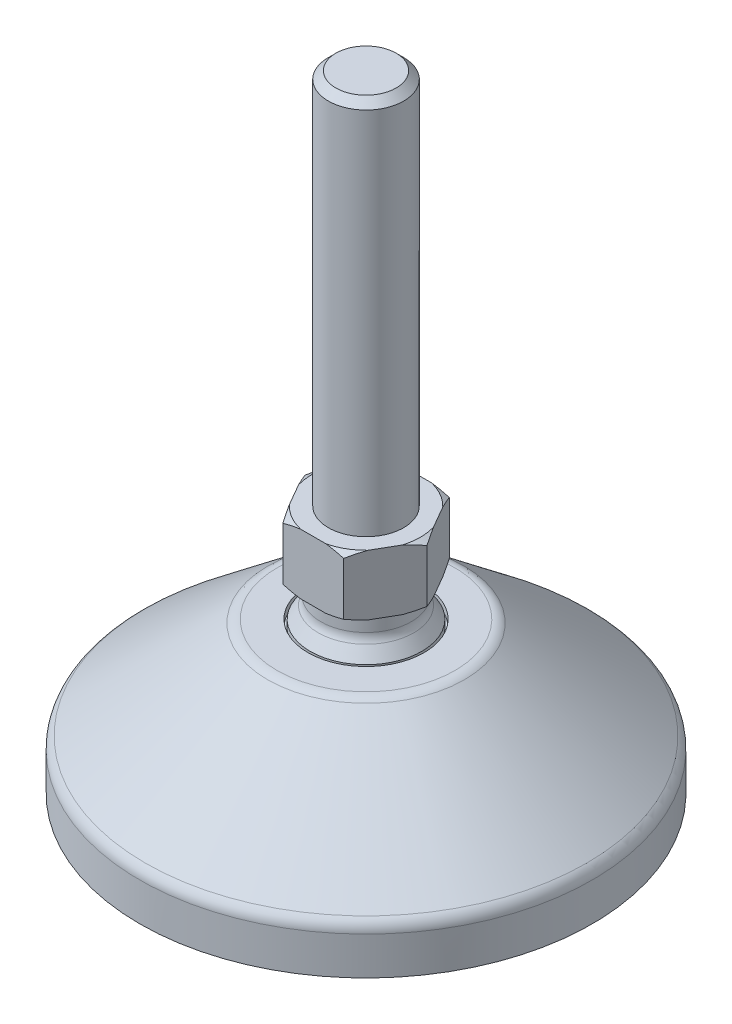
ISO-10303-21;
HEADER;
FILE_DESCRIPTION(('STEP AP214'),'2;1');
FILE_NAME('part.step','',(''),(''),'','','');
FILE_SCHEMA(('AUTOMOTIVE_DESIGN { 1 0 10303 214 1 1 1 1 }'));
ENDSEC;
DATA;
#1=APPLICATION_CONTEXT('core data for automotive mechanical design processes');
#2=APPLICATION_PROTOCOL_DEFINITION('international standard','automotive_design',2000,#1);
#3=PRODUCT_CONTEXT('',#1,'mechanical');
#4=PRODUCT('Part','Part','',(#3));
#5=PRODUCT_RELATED_PRODUCT_CATEGORY('part','',(#4));
#6=PRODUCT_DEFINITION_FORMATION('','',#4);
#7=PRODUCT_DEFINITION_CONTEXT('part definition',#1,'design');
#8=PRODUCT_DEFINITION('design','',#6,#7);
#9=PRODUCT_DEFINITION_SHAPE('','',#8);
#10=(LENGTH_UNIT() NAMED_UNIT(*) SI_UNIT(.MILLI.,.METRE.));
#11=(NAMED_UNIT(*) PLANE_ANGLE_UNIT() SI_UNIT($,.RADIAN.));
#12=(NAMED_UNIT(*) SI_UNIT($,.STERADIAN.) SOLID_ANGLE_UNIT());
#13=UNCERTAINTY_MEASURE_WITH_UNIT(LENGTH_MEASURE(1.E-05),#10,'distance_accuracy_value','');
#14=(GEOMETRIC_REPRESENTATION_CONTEXT(3) GLOBAL_UNCERTAINTY_ASSIGNED_CONTEXT((#13)) GLOBAL_UNIT_ASSIGNED_CONTEXT((#10,
#11,#12)) REPRESENTATION_CONTEXT('',''));
#15=CARTESIAN_POINT('',(0.,0.,0.));
#16=DIRECTION('',(0.,0.,1.));
#17=DIRECTION('',(1.,0.,0.));
#18=AXIS2_PLACEMENT_3D('',#15,#16,#17);
#19=CARTESIAN_POINT('',(0.,0.,0.));
#20=DIRECTION('',(0.,1.,0.));
#21=DIRECTION('',(0.,0.,1.));
#22=AXIS2_PLACEMENT_3D('',#19,#20,#21);
#23=PLANE('',#22);
#24=CARTESIAN_POINT('',(0.,0.,0.));
#25=DIRECTION('',(0.,-1.,0.));
#26=DIRECTION('',(0.,0.,-1.));
#27=AXIS2_PLACEMENT_3D('',#24,#25,#26);
#28=CIRCLE('',#27,21.5);
#29=CARTESIAN_POINT('',(-4.19512195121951,0.,21.0867482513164));
#30=VERTEX_POINT('',#29);
#31=CARTESIAN_POINT('',(-20.2077439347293,0.,7.34146341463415));
#32=VERTEX_POINT('',#31);
#33=EDGE_CURVE('E658',#30,#32,#28,.T.);
#34=ORIENTED_EDGE('',*,*,#33,.F.);
#35=CARTESIAN_POINT('',(-4.,0.,20.1059692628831));
#36=DIRECTION('',(0.,1.,0.));
#37=DIRECTION('',(0.,0.,1.));
#38=AXIS2_PLACEMENT_3D('',#35,#36,#37);
#39=CIRCLE('',#38,1.);
#40=CARTESIAN_POINT('',(-3.,0.,20.1059692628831));
#41=VERTEX_POINT('',#40);
#42=EDGE_CURVE('E838',#30,#41,#39,.T.);
#43=ORIENTED_EDGE('',*,*,#42,.T.);
#44=DIRECTION('',(0.,0.,1.));
#45=VECTOR('',#44,1.);
#46=CARTESIAN_POINT('',(-3.,0.,6.));
#47=LINE('',#46,#45);
#48=CARTESIAN_POINT('',(-3.,0.,7.));
#49=VERTEX_POINT('',#48);
#50=EDGE_CURVE('E649',#49,#41,#47,.T.);
#51=ORIENTED_EDGE('',*,*,#50,.F.);
#52=CARTESIAN_POINT('',(-4.,0.,7.));
#53=DIRECTION('',(0.,1.,0.));
#54=DIRECTION('',(0.,0.,1.));
#55=AXIS2_PLACEMENT_3D('',#52,#53,#54);
#56=CIRCLE('',#55,1.);
#57=CARTESIAN_POINT('',(-4.,0.,6.));
#58=VERTEX_POINT('',#57);
#59=EDGE_CURVE('E841',#49,#58,#56,.T.);
#60=ORIENTED_EDGE('',*,*,#59,.T.);
#61=DIRECTION('',(1.,0.,0.));
#62=VECTOR('',#61,1.);
#63=CARTESIAN_POINT('',(-20.6458228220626,0.,6.));
#64=LINE('',#63,#62);
#65=CARTESIAN_POINT('',(-19.2678488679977,0.,6.));
#66=VERTEX_POINT('',#65);
#67=EDGE_CURVE('E654',#66,#58,#64,.T.);
#68=ORIENTED_EDGE('',*,*,#67,.F.);
#69=CARTESIAN_POINT('',(-19.2678488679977,0.,7.));
#70=DIRECTION('',(0.,1.,0.));
#71=DIRECTION('',(0.,0.,1.));
#72=AXIS2_PLACEMENT_3D('',#69,#70,#71);
#73=CIRCLE('',#72,1.);
#74=EDGE_CURVE('E844',#66,#32,#73,.T.);
#75=ORIENTED_EDGE('',*,*,#74,.T.);
#76=EDGE_LOOP('',(#34,#43,#51,#60,#68,#75));
#77=FACE_BOUND('',#76,.T.);
#78=CARTESIAN_POINT('',(0.,0.,0.));
#79=DIRECTION('',(0.,1.,0.));
#80=DIRECTION('',(0.,0.,1.));
#81=AXIS2_PLACEMENT_3D('',#78,#79,#80);
#82=CIRCLE('',#81,25.75);
#83=CARTESIAN_POINT('',(0.,0.,25.75));
#84=VERTEX_POINT('',#83);
#85=EDGE_CURVE('E389',#84,#84,#82,.T.);
#86=ORIENTED_EDGE('',*,*,#85,.F.);
#87=EDGE_LOOP('',(#86));
#88=FACE_BOUND('',#87,.T.);
#89=DIRECTION('',(0.,0.,-1.));
#90=VECTOR('',#89,1.);
#91=CARTESIAN_POINT('',(3.,0.,6.));
#92=LINE('',#91,#90);
#93=CARTESIAN_POINT('',(3.,0.,20.1059692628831));
#94=VERTEX_POINT('',#93);
#95=CARTESIAN_POINT('',(3.,0.,7.));
#96=VERTEX_POINT('',#95);
#97=EDGE_CURVE('E610',#94,#96,#92,.T.);
#98=ORIENTED_EDGE('',*,*,#97,.F.);
#99=CARTESIAN_POINT('',(4.,0.,20.1059692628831));
#100=DIRECTION('',(0.,1.,0.));
#101=DIRECTION('',(0.,0.,1.));
#102=AXIS2_PLACEMENT_3D('',#99,#100,#101);
#103=CIRCLE('',#102,1.);
#104=CARTESIAN_POINT('',(4.19512195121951,0.,21.0867482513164));
#105=VERTEX_POINT('',#104);
#106=EDGE_CURVE('E832',#94,#105,#103,.T.);
#107=ORIENTED_EDGE('',*,*,#106,.T.);
#108=CARTESIAN_POINT('',(0.,0.,0.));
#109=DIRECTION('',(0.,-1.,0.));
#110=DIRECTION('',(0.,0.,-1.));
#111=AXIS2_PLACEMENT_3D('',#108,#109,#110);
#112=CIRCLE('',#111,21.5);
#113=CARTESIAN_POINT('',(20.2077439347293,0.,7.34146341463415));
#114=VERTEX_POINT('',#113);
#115=EDGE_CURVE('E601',#114,#105,#112,.T.);
#116=ORIENTED_EDGE('',*,*,#115,.F.);
#117=CARTESIAN_POINT('',(19.2678488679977,0.,7.));
#118=DIRECTION('',(0.,1.,0.));
#119=DIRECTION('',(0.,0.,1.));
#120=AXIS2_PLACEMENT_3D('',#117,#118,#119);
#121=CIRCLE('',#120,1.);
#122=CARTESIAN_POINT('',(19.2678488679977,0.,6.));
#123=VERTEX_POINT('',#122);
#124=EDGE_CURVE('E829',#114,#123,#121,.T.);
#125=ORIENTED_EDGE('',*,*,#124,.T.);
#126=DIRECTION('',(1.,0.,0.));
#127=VECTOR('',#126,1.);
#128=CARTESIAN_POINT('',(3.,0.,6.));
#129=LINE('',#128,#127);
#130=CARTESIAN_POINT('',(4.,0.,6.));
#131=VERTEX_POINT('',#130);
#132=EDGE_CURVE('E606',#131,#123,#129,.T.);
#133=ORIENTED_EDGE('',*,*,#132,.F.);
#134=CARTESIAN_POINT('',(4.,0.,7.));
#135=DIRECTION('',(0.,1.,0.));
#136=DIRECTION('',(0.,0.,1.));
#137=AXIS2_PLACEMENT_3D('',#134,#135,#136);
#138=CIRCLE('',#137,1.);
#139=EDGE_CURVE('E835',#131,#96,#138,.T.);
#140=ORIENTED_EDGE('',*,*,#139,.T.);
#141=EDGE_LOOP('',(#98,#107,#116,#125,#133,#140));
#142=FACE_BOUND('',#141,.T.);
#143=CARTESIAN_POINT('',(0.,0.,0.));
#144=DIRECTION('',(0.,-1.,0.));
#145=DIRECTION('',(0.,0.,-1.));
#146=AXIS2_PLACEMENT_3D('',#143,#144,#145);
#147=CIRCLE('',#146,21.5);
#148=CARTESIAN_POINT('',(-20.2077439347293,0.,-7.34146341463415));
#149=VERTEX_POINT('',#148);
#150=CARTESIAN_POINT('',(-4.19512195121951,0.,-21.0867482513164));
#151=VERTEX_POINT('',#150);
#152=EDGE_CURVE('E634',#149,#151,#147,.T.);
#153=ORIENTED_EDGE('',*,*,#152,.F.);
#154=CARTESIAN_POINT('',(-19.2678488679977,0.,-7.));
#155=DIRECTION('',(0.,1.,0.));
#156=DIRECTION('',(0.,0.,1.));
#157=AXIS2_PLACEMENT_3D('',#154,#155,#156);
#158=CIRCLE('',#157,1.);
#159=CARTESIAN_POINT('',(-19.2678488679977,0.,-6.));
#160=VERTEX_POINT('',#159);
#161=EDGE_CURVE('E847',#149,#160,#158,.T.);
#162=ORIENTED_EDGE('',*,*,#161,.T.);
#163=DIRECTION('',(-1.,0.,0.));
#164=VECTOR('',#163,1.);
#165=CARTESIAN_POINT('',(-20.6458228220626,0.,-6.));
#166=LINE('',#165,#164);
#167=CARTESIAN_POINT('',(-4.,0.,-6.));
#168=VERTEX_POINT('',#167);
#169=EDGE_CURVE('E626',#168,#160,#166,.T.);
#170=ORIENTED_EDGE('',*,*,#169,.F.);
#171=CARTESIAN_POINT('',(-4.,0.,-7.));
#172=DIRECTION('',(0.,1.,0.));
#173=DIRECTION('',(0.,0.,1.));
#174=AXIS2_PLACEMENT_3D('',#171,#172,#173);
#175=CIRCLE('',#174,1.);
#176=CARTESIAN_POINT('',(-3.,0.,-7.));
#177=VERTEX_POINT('',#176);
#178=EDGE_CURVE('E12',#168,#177,#175,.T.);
#179=ORIENTED_EDGE('',*,*,#178,.T.);
#180=DIRECTION('',(0.,0.,1.));
#181=VECTOR('',#180,1.);
#182=CARTESIAN_POINT('',(-3.,0.,-21.2896688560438));
#183=LINE('',#182,#181);
#184=CARTESIAN_POINT('',(-3.,0.,-20.1059692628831));
#185=VERTEX_POINT('',#184);
#186=EDGE_CURVE('E631',#185,#177,#183,.T.);
#187=ORIENTED_EDGE('',*,*,#186,.F.);
#188=CARTESIAN_POINT('',(-4.,0.,-20.1059692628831));
#189=DIRECTION('',(0.,1.,0.));
#190=DIRECTION('',(0.,0.,1.));
#191=AXIS2_PLACEMENT_3D('',#188,#189,#190);
#192=CIRCLE('',#191,1.);
#193=EDGE_CURVE('E66',#185,#151,#192,.T.);
#194=ORIENTED_EDGE('',*,*,#193,.T.);
#195=EDGE_LOOP('',(#153,#162,#170,#179,#187,#194));
#196=FACE_BOUND('',#195,.T.);
#197=CARTESIAN_POINT('',(0.,0.,0.));
#198=DIRECTION('',(0.,-1.,0.));
#199=DIRECTION('',(0.,0.,-1.));
#200=AXIS2_PLACEMENT_3D('',#197,#198,#199);
#201=CIRCLE('',#200,21.5);
#202=CARTESIAN_POINT('',(4.19512195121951,0.,-21.0867482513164));
#203=VERTEX_POINT('',#202);
#204=CARTESIAN_POINT('',(20.2077439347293,0.,-7.34146341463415));
#205=VERTEX_POINT('',#204);
#206=EDGE_CURVE('E682',#203,#205,#201,.T.);
#207=ORIENTED_EDGE('',*,*,#206,.F.);
#208=CARTESIAN_POINT('',(4.,0.,-20.1059692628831));
#209=DIRECTION('',(0.,1.,0.));
#210=DIRECTION('',(0.,0.,1.));
#211=AXIS2_PLACEMENT_3D('',#208,#209,#210);
#212=CIRCLE('',#211,1.);
#213=CARTESIAN_POINT('',(3.,0.,-20.1059692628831));
#214=VERTEX_POINT('',#213);
#215=EDGE_CURVE('E820',#203,#214,#212,.T.);
#216=ORIENTED_EDGE('',*,*,#215,.T.);
#217=DIRECTION('',(0.,0.,-1.));
#218=VECTOR('',#217,1.);
#219=CARTESIAN_POINT('',(3.,0.,-21.2896688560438));
#220=LINE('',#219,#218);
#221=CARTESIAN_POINT('',(3.,0.,-7.));
#222=VERTEX_POINT('',#221);
#223=EDGE_CURVE('E673',#222,#214,#220,.T.);
#224=ORIENTED_EDGE('',*,*,#223,.F.);
#225=CARTESIAN_POINT('',(4.,0.,-7.));
#226=DIRECTION('',(0.,1.,0.));
#227=DIRECTION('',(0.,0.,1.));
#228=AXIS2_PLACEMENT_3D('',#225,#226,#227);
#229=CIRCLE('',#228,1.);
#230=CARTESIAN_POINT('',(4.,0.,-6.));
#231=VERTEX_POINT('',#230);
#232=EDGE_CURVE('E823',#222,#231,#229,.T.);
#233=ORIENTED_EDGE('',*,*,#232,.T.);
#234=DIRECTION('',(-1.,0.,0.));
#235=VECTOR('',#234,1.);
#236=CARTESIAN_POINT('',(3.,0.,-6.));
#237=LINE('',#236,#235);
#238=CARTESIAN_POINT('',(19.2678488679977,0.,-6.));
#239=VERTEX_POINT('',#238);
#240=EDGE_CURVE('E678',#239,#231,#237,.T.);
#241=ORIENTED_EDGE('',*,*,#240,.F.);
#242=CARTESIAN_POINT('',(19.2678488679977,0.,-7.));
#243=DIRECTION('',(0.,1.,0.));
#244=DIRECTION('',(0.,0.,1.));
#245=AXIS2_PLACEMENT_3D('',#242,#243,#244);
#246=CIRCLE('',#245,1.);
#247=EDGE_CURVE('E826',#239,#205,#246,.T.);
#248=ORIENTED_EDGE('',*,*,#247,.T.);
#249=EDGE_LOOP('',(#207,#216,#224,#233,#241,#248));
#250=FACE_BOUND('',#249,.T.);
#251=ADVANCED_FACE('F57',(#77,#88,#142,#196,#250),#23,.F.);
#252=CARTESIAN_POINT('',(0.,27.,0.));
#253=DIRECTION('',(0.,1.,0.));
#254=DIRECTION('',(0.,0.,1.));
#255=AXIS2_PLACEMENT_3D('',#252,#253,#254);
#256=PLANE('',#255);
#257=CARTESIAN_POINT('',(0.,27.,0.));
#258=DIRECTION('',(0.,1.,0.));
#259=DIRECTION('',(0.,0.,1.));
#260=AXIS2_PLACEMENT_3D('',#257,#258,#259);
#261=CIRCLE('',#260,6.);
#262=CARTESIAN_POINT('',(0.,27.,6.));
#263=VERTEX_POINT('',#262);
#264=EDGE_CURVE('E357',#263,#263,#261,.T.);
#265=ORIENTED_EDGE('',*,*,#264,.T.);
#266=EDGE_LOOP('',(#265));
#267=FACE_BOUND('',#266,.T.);
#268=DIRECTION('',(1.,0.,0.));
#269=VECTOR('',#268,1.);
#270=CARTESIAN_POINT('',(-4.04145188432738,27.,7.));
#271=LINE('',#270,#269);
#272=CARTESIAN_POINT('',(-1.68522995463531,27.,7.));
#273=VERTEX_POINT('',#272);
#274=CARTESIAN_POINT('',(1.68522995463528,27.,7.));
#275=VERTEX_POINT('',#274);
#276=EDGE_CURVE('E514',#273,#275,#271,.T.);
#277=ORIENTED_EDGE('',*,*,#276,.F.);
#278=CARTESIAN_POINT('',(0.,27.,0.));
#279=DIRECTION('',(0.,1.,0.));
#280=DIRECTION('',(0.,0.,1.));
#281=AXIS2_PLACEMENT_3D('',#278,#279,#280);
#282=CIRCLE('',#281,7.2);
#283=CARTESIAN_POINT('',(-5.21956284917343,27.,4.95945195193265));
#284=VERTEX_POINT('',#283);
#285=EDGE_CURVE('E591',#284,#273,#282,.T.);
#286=ORIENTED_EDGE('',*,*,#285,.F.);
#287=DIRECTION('',(0.5,0.,0.866025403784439));
#288=VECTOR('',#287,1.);
#289=CARTESIAN_POINT('',(-8.08290376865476,27.,0.));
#290=LINE('',#289,#288);
#291=CARTESIAN_POINT('',(-6.90479280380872,27.,2.04054804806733));
#292=VERTEX_POINT('',#291);
#293=EDGE_CURVE('E548',#292,#284,#290,.T.);
#294=ORIENTED_EDGE('',*,*,#293,.F.);
#295=CARTESIAN_POINT('',(-6.90479280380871,27.,-2.04054804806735));
#296=VERTEX_POINT('',#295);
#297=EDGE_CURVE('E588',#296,#292,#282,.T.);
#298=ORIENTED_EDGE('',*,*,#297,.F.);
#299=DIRECTION('',(-0.5,0.,0.866025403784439));
#300=VECTOR('',#299,1.);
#301=CARTESIAN_POINT('',(-4.04145188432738,27.,-7.));
#302=LINE('',#301,#300);
#303=CARTESIAN_POINT('',(-5.21956284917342,27.,-4.95945195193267));
#304=VERTEX_POINT('',#303);
#305=EDGE_CURVE('E544',#304,#296,#302,.T.);
#306=ORIENTED_EDGE('',*,*,#305,.F.);
#307=CARTESIAN_POINT('',(-1.68522995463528,27.,-7.));
#308=VERTEX_POINT('',#307);
#309=EDGE_CURVE('E580',#308,#304,#282,.T.);
#310=ORIENTED_EDGE('',*,*,#309,.F.);
#311=DIRECTION('',(-1.,0.,0.));
#312=VECTOR('',#311,1.);
#313=CARTESIAN_POINT('',(4.04145188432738,27.,-7.));
#314=LINE('',#313,#312);
#315=CARTESIAN_POINT('',(1.6852299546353,27.,-7.));
#316=VERTEX_POINT('',#315);
#317=EDGE_CURVE('E540',#316,#308,#314,.T.);
#318=ORIENTED_EDGE('',*,*,#317,.F.);
#319=CARTESIAN_POINT('',(5.21956284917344,27.,-4.95945195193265));
#320=VERTEX_POINT('',#319);
#321=EDGE_CURVE('E587',#320,#316,#282,.T.);
#322=ORIENTED_EDGE('',*,*,#321,.F.);
#323=DIRECTION('',(-0.5,0.,-0.866025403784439));
#324=VECTOR('',#323,1.);
#325=CARTESIAN_POINT('',(8.08290376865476,27.,0.));
#326=LINE('',#325,#324);
#327=CARTESIAN_POINT('',(6.90479280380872,27.,-2.04054804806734));
#328=VERTEX_POINT('',#327);
#329=EDGE_CURVE('E537',#328,#320,#326,.T.);
#330=ORIENTED_EDGE('',*,*,#329,.F.);
#331=CARTESIAN_POINT('',(6.90479280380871,27.,2.04054804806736));
#332=VERTEX_POINT('',#331);
#333=EDGE_CURVE('E330',#332,#328,#282,.T.);
#334=ORIENTED_EDGE('',*,*,#333,.F.);
#335=DIRECTION('',(0.5,0.,-0.866025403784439));
#336=VECTOR('',#335,1.);
#337=CARTESIAN_POINT('',(4.04145188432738,27.,7.));
#338=LINE('',#337,#336);
#339=CARTESIAN_POINT('',(5.21956284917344,27.,4.95945195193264));
#340=VERTEX_POINT('',#339);
#341=EDGE_CURVE('E346',#340,#332,#338,.T.);
#342=ORIENTED_EDGE('',*,*,#341,.F.);
#343=EDGE_CURVE('E592',#275,#340,#282,.T.);
#344=ORIENTED_EDGE('',*,*,#343,.F.);
#345=EDGE_LOOP('',(#277,#286,#294,#298,#306,#310,#318,#322,#330,#334,#342,#344));
#346=FACE_BOUND('',#345,.T.);
#347=ADVANCED_FACE('F583',(#267,#346),#256,.F.);
#348=CARTESIAN_POINT('',(0.,35.,0.));
#349=DIRECTION('',(0.,1.,0.));
#350=DIRECTION('',(0.,0.,1.));
#351=AXIS2_PLACEMENT_3D('',#348,#349,#350);
#352=PLANE('',#351);
#353=CARTESIAN_POINT('',(0.,35.,0.));
#354=DIRECTION('',(0.,1.,0.));
#355=DIRECTION('',(0.,0.,1.));
#356=AXIS2_PLACEMENT_3D('',#353,#354,#355);
#357=CIRCLE('',#356,5.);
#358=CARTESIAN_POINT('',(0.,35.,-5.));
#359=VERTEX_POINT('',#358);
#360=EDGE_CURVE('E504',#359,#359,#357,.T.);
#361=ORIENTED_EDGE('',*,*,#360,.F.);
#362=EDGE_LOOP('',(#361));
#363=FACE_BOUND('',#362,.T.);
#364=CARTESIAN_POINT('',(0.,35.,0.));
#365=DIRECTION('',(0.,1.,0.));
#366=DIRECTION('',(0.,0.,1.));
#367=AXIS2_PLACEMENT_3D('',#364,#365,#366);
#368=CIRCLE('',#367,7.2);
#369=CARTESIAN_POINT('',(-5.21956284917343,35.,4.95945195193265));
#370=VERTEX_POINT('',#369);
#371=CARTESIAN_POINT('',(-1.68522995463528,35.,7.));
#372=VERTEX_POINT('',#371);
#373=EDGE_CURVE('E595',#370,#372,#368,.T.);
#374=ORIENTED_EDGE('',*,*,#373,.T.);
#375=DIRECTION('',(1.,0.,0.));
#376=VECTOR('',#375,1.);
#377=CARTESIAN_POINT('',(-4.04145188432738,35.,7.));
#378=LINE('',#377,#376);
#379=CARTESIAN_POINT('',(1.68522995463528,35.,7.));
#380=VERTEX_POINT('',#379);
#381=EDGE_CURVE('E530',#372,#380,#378,.T.);
#382=ORIENTED_EDGE('',*,*,#381,.T.);
#383=CARTESIAN_POINT('',(5.21956284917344,35.,4.95945195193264));
#384=VERTEX_POINT('',#383);
#385=EDGE_CURVE('E596',#380,#384,#368,.T.);
#386=ORIENTED_EDGE('',*,*,#385,.T.);
#387=DIRECTION('',(0.5,0.,-0.866025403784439));
#388=VECTOR('',#387,1.);
#389=CARTESIAN_POINT('',(4.04145188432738,35.,7.));
#390=LINE('',#389,#388);
#391=CARTESIAN_POINT('',(6.90479280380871,35.,2.04054804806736));
#392=VERTEX_POINT('',#391);
#393=EDGE_CURVE('E509',#384,#392,#390,.T.);
#394=ORIENTED_EDGE('',*,*,#393,.T.);
#395=CARTESIAN_POINT('',(6.90479280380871,35.,-2.04054804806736));
#396=VERTEX_POINT('',#395);
#397=EDGE_CURVE('E600',#392,#396,#368,.T.);
#398=ORIENTED_EDGE('',*,*,#397,.T.);
#399=DIRECTION('',(-0.5,0.,-0.866025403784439));
#400=VECTOR('',#399,1.);
#401=CARTESIAN_POINT('',(8.08290376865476,35.,0.));
#402=LINE('',#401,#400);
#403=CARTESIAN_POINT('',(5.21956284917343,35.,-4.95945195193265));
#404=VERTEX_POINT('',#403);
#405=EDGE_CURVE('E513',#396,#404,#402,.T.);
#406=ORIENTED_EDGE('',*,*,#405,.T.);
#407=CARTESIAN_POINT('',(1.68522995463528,35.,-7.));
#408=VERTEX_POINT('',#407);
#409=EDGE_CURVE('E1765',#404,#408,#368,.T.);
#410=ORIENTED_EDGE('',*,*,#409,.T.);
#411=DIRECTION('',(-1.,0.,0.));
#412=VECTOR('',#411,1.);
#413=CARTESIAN_POINT('',(4.04145188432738,35.,-7.));
#414=LINE('',#413,#412);
#415=CARTESIAN_POINT('',(-1.68522995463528,35.,-7.));
#416=VERTEX_POINT('',#415);
#417=EDGE_CURVE('E518',#408,#416,#414,.T.);
#418=ORIENTED_EDGE('',*,*,#417,.T.);
#419=CARTESIAN_POINT('',(-5.21956284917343,35.,-4.95945195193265));
#420=VERTEX_POINT('',#419);
#421=EDGE_CURVE('E1762',#416,#420,#368,.T.);
#422=ORIENTED_EDGE('',*,*,#421,.T.);
#423=DIRECTION('',(-0.5,0.,0.866025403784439));
#424=VECTOR('',#423,1.);
#425=CARTESIAN_POINT('',(-4.04145188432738,35.,-7.));
#426=LINE('',#425,#424);
#427=CARTESIAN_POINT('',(-6.90479280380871,35.,-2.04054804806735));
#428=VERTEX_POINT('',#427);
#429=EDGE_CURVE('E522',#420,#428,#426,.T.);
#430=ORIENTED_EDGE('',*,*,#429,.T.);
#431=CARTESIAN_POINT('',(-6.90479280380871,35.,2.04054804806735));
#432=VERTEX_POINT('',#431);
#433=EDGE_CURVE('E1760',#428,#432,#368,.T.);
#434=ORIENTED_EDGE('',*,*,#433,.T.);
#435=DIRECTION('',(0.5,0.,0.866025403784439));
#436=VECTOR('',#435,1.);
#437=CARTESIAN_POINT('',(-8.08290376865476,35.,0.));
#438=LINE('',#437,#436);
#439=EDGE_CURVE('E526',#432,#370,#438,.T.);
#440=ORIENTED_EDGE('',*,*,#439,.T.);
#441=EDGE_LOOP('',(#374,#382,#386,#394,#398,#406,#410,#418,#422,#430,#434,#440));
#442=FACE_BOUND('',#441,.T.);
#443=ADVANCED_FACE('F428',(#363,#442),#352,.T.);
#444=CARTESIAN_POINT('',(0.,22.,0.));
#445=DIRECTION('',(0.,1.,0.));
#446=DIRECTION('',(0.,0.,1.));
#447=AXIS2_PLACEMENT_3D('',#444,#445,#446);
#448=PLANE('',#447);
#449=CARTESIAN_POINT('',(0.,22.,0.));
#450=DIRECTION('',(0.,1.,0.));
#451=DIRECTION('',(0.,0.,1.));
#452=AXIS2_PLACEMENT_3D('',#449,#450,#451);
#453=CIRCLE('',#452,11.7984378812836);
#454=CARTESIAN_POINT('',(0.,22.,11.7984378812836));
#455=VERTEX_POINT('',#454);
#456=EDGE_CURVE('E1649',#455,#455,#453,.T.);
#457=ORIENTED_EDGE('',*,*,#456,.T.);
#458=EDGE_LOOP('',(#457));
#459=FACE_BOUND('',#458,.T.);
#460=CARTESIAN_POINT('',(0.,22.,0.));
#461=DIRECTION('',(0.,1.,0.));
#462=DIRECTION('',(0.,0.,1.));
#463=AXIS2_PLACEMENT_3D('',#460,#461,#462);
#464=CIRCLE('',#463,7.7);
#465=CARTESIAN_POINT('',(0.,22.,7.7));
#466=VERTEX_POINT('',#465);
#467=EDGE_CURVE('E374',#466,#466,#464,.T.);
#468=ORIENTED_EDGE('',*,*,#467,.F.);
#469=EDGE_LOOP('',(#468));
#470=FACE_BOUND('',#469,.T.);
#471=ADVANCED_FACE('F900',(#459,#470),#448,.T.);
#472=CARTESIAN_POINT('',(0.,2.,0.));
#473=DIRECTION('',(0.,-1.,0.));
#474=DIRECTION('',(0.,0.,-1.));
#475=AXIS2_PLACEMENT_3D('',#472,#473,#474);
#476=CYLINDRICAL_SURFACE('',#475,25.75);
#477=CARTESIAN_POINT('',(0.,2.,0.));
#478=DIRECTION('',(0.,1.,0.));
#479=DIRECTION('',(0.,0.,1.));
#480=AXIS2_PLACEMENT_3D('',#477,#478,#479);
#481=CIRCLE('',#480,25.75);
#482=CARTESIAN_POINT('',(0.,2.,25.75));
#483=VERTEX_POINT('',#482);
#484=EDGE_CURVE('E390',#483,#483,#481,.T.);
#485=ORIENTED_EDGE('',*,*,#484,.F.);
#486=EDGE_LOOP('',(#485));
#487=FACE_BOUND('',#486,.T.);
#488=ORIENTED_EDGE('',*,*,#85,.T.);
#489=EDGE_LOOP('',(#488));
#490=FACE_BOUND('',#489,.T.);
#491=ADVANCED_FACE('F897',(#487,#490),#476,.T.);
#492=CARTESIAN_POINT('',(0.,8.,0.));
#493=DIRECTION('',(0.,-1.,0.));
#494=DIRECTION('',(0.,0.,-1.));
#495=AXIS2_PLACEMENT_3D('',#492,#493,#494);
#496=CYLINDRICAL_SURFACE('',#495,30.);
#497=CARTESIAN_POINT('',(0.,7.03875030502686,0.));
#498=DIRECTION('',(0.,-1.,0.));
#499=DIRECTION('',(0.,0.,-1.));
#500=AXIS2_PLACEMENT_3D('',#497,#498,#499);
#501=CIRCLE('',#500,30.);
#502=CARTESIAN_POINT('',(0.,7.03875030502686,-30.));
#503=VERTEX_POINT('',#502);
#504=EDGE_CURVE('E1645',#503,#503,#501,.T.);
#505=ORIENTED_EDGE('',*,*,#504,.T.);
#506=EDGE_LOOP('',(#505));
#507=FACE_BOUND('',#506,.T.);
#508=CARTESIAN_POINT('',(0.,2.,0.));
#509=DIRECTION('',(0.,1.,0.));
#510=DIRECTION('',(0.,0.,1.));
#511=AXIS2_PLACEMENT_3D('',#508,#509,#510);
#512=CIRCLE('',#511,30.);
#513=CARTESIAN_POINT('',(0.,2.,30.));
#514=VERTEX_POINT('',#513);
#515=EDGE_CURVE('E382',#514,#514,#512,.T.);
#516=ORIENTED_EDGE('',*,*,#515,.T.);
#517=EDGE_LOOP('',(#516));
#518=FACE_BOUND('',#517,.T.);
#519=ADVANCED_FACE('F895',(#507,#518),#496,.T.);
#520=CARTESIAN_POINT('',(0.,2.,0.));
#521=DIRECTION('',(0.,1.,0.));
#522=DIRECTION('',(0.,0.,1.));
#523=AXIS2_PLACEMENT_3D('',#520,#521,#522);
#524=PLANE('',#523);
#525=ORIENTED_EDGE('',*,*,#484,.T.);
#526=EDGE_LOOP('',(#525));
#527=FACE_BOUND('',#526,.T.);
#528=ORIENTED_EDGE('',*,*,#515,.F.);
#529=EDGE_LOOP('',(#528));
#530=FACE_BOUND('',#529,.T.);
#531=ADVANCED_FACE('F1530',(#527,#530),#524,.F.);
#532=CARTESIAN_POINT('',(0.,22.,0.));
#533=DIRECTION('',(0.,-1.,0.));
#534=DIRECTION('',(0.,0.,-1.));
#535=AXIS2_PLACEMENT_3D('',#532,#533,#534);
#536=CONICAL_SURFACE('',#535,12.5,0.896055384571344);
#537=CARTESIAN_POINT('',(0.,8.60048792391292,0.));
#538=DIRECTION('',(0.,-1.,0.));
#539=DIRECTION('',(0.,0.,-1.));
#540=AXIS2_PLACEMENT_3D('',#537,#538,#539);
#541=CIRCLE('',#540,29.2493900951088);
#542=CARTESIAN_POINT('',(0.,8.60048792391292,-29.2493900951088));
#543=VERTEX_POINT('',#542);
#544=EDGE_CURVE('E1650',#543,#543,#541,.F.);
#545=ORIENTED_EDGE('',*,*,#544,.T.);
#546=EDGE_LOOP('',(#545));
#547=FACE_BOUND('',#546,.T.);
#548=CARTESIAN_POINT('',(0.,21.5617376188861,0.));
#549=DIRECTION('',(0.,1.,0.));
#550=DIRECTION('',(0.,0.,1.));
#551=AXIS2_PLACEMENT_3D('',#548,#549,#550);
#552=CIRCLE('',#551,13.0478279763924);
#553=CARTESIAN_POINT('',(0.,21.5617376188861,13.0478279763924));
#554=VERTEX_POINT('',#553);
#555=EDGE_CURVE('E1658',#554,#554,#552,.F.);
#556=ORIENTED_EDGE('',*,*,#555,.T.);
#557=EDGE_LOOP('',(#556));
#558=FACE_BOUND('',#557,.T.);
#559=ADVANCED_FACE('F1504',(#547,#558),#536,.T.);
#560=CARTESIAN_POINT('',(0.,21.,0.));
#561=DIRECTION('',(0.,1.,0.));
#562=DIRECTION('',(0.,0.,1.));
#563=AXIS2_PLACEMENT_3D('',#560,#561,#562);
#564=CYLINDRICAL_SURFACE('',#563,7.7);
#565=CARTESIAN_POINT('',(0.,21.,0.));
#566=DIRECTION('',(0.,1.,0.));
#567=DIRECTION('',(0.,0.,1.));
#568=AXIS2_PLACEMENT_3D('',#565,#566,#567);
#569=CIRCLE('',#568,7.7);
#570=CARTESIAN_POINT('',(0.,21.,7.7));
#571=VERTEX_POINT('',#570);
#572=EDGE_CURVE('E378',#571,#571,#569,.T.);
#573=ORIENTED_EDGE('',*,*,#572,.F.);
#574=EDGE_LOOP('',(#573));
#575=FACE_BOUND('',#574,.T.);
#576=ORIENTED_EDGE('',*,*,#467,.T.);
#577=EDGE_LOOP('',(#576));
#578=FACE_BOUND('',#577,.T.);
#579=ADVANCED_FACE('F1495',(#575,#578),#564,.F.);
#580=CARTESIAN_POINT('',(0.,21.,0.));
#581=DIRECTION('',(0.,1.,0.));
#582=DIRECTION('',(0.,0.,1.));
#583=AXIS2_PLACEMENT_3D('',#580,#581,#582);
#584=PLANE('',#583);
#585=CARTESIAN_POINT('',(0.,21.,0.));
#586=DIRECTION('',(0.,1.,0.));
#587=DIRECTION('',(0.,0.,1.));
#588=AXIS2_PLACEMENT_3D('',#585,#586,#587);
#589=CIRCLE('',#588,7.4);
#590=CARTESIAN_POINT('',(0.,21.,7.4));
#591=VERTEX_POINT('',#590);
#592=EDGE_CURVE('E370',#591,#591,#589,.T.);
#593=ORIENTED_EDGE('',*,*,#592,.F.);
#594=EDGE_LOOP('',(#593));
#595=FACE_BOUND('',#594,.T.);
#596=ORIENTED_EDGE('',*,*,#572,.T.);
#597=EDGE_LOOP('',(#596));
#598=FACE_BOUND('',#597,.T.);
#599=ADVANCED_FACE('F1486',(#595,#598),#584,.T.);
#600=CARTESIAN_POINT('',(0.,21.,0.));
#601=DIRECTION('',(0.,1.,0.));
#602=DIRECTION('',(0.,0.,1.));
#603=AXIS2_PLACEMENT_3D('',#600,#601,#602);
#604=CYLINDRICAL_SURFACE('',#603,7.4);
#605=ORIENTED_EDGE('',*,*,#592,.T.);
#606=EDGE_LOOP('',(#605));
#607=FACE_BOUND('',#606,.T.);
#608=CARTESIAN_POINT('',(0.,22.,0.));
#609=DIRECTION('',(0.,1.,0.));
#610=DIRECTION('',(0.,0.,1.));
#611=AXIS2_PLACEMENT_3D('',#608,#609,#610);
#612=CIRCLE('',#611,7.4);
#613=CARTESIAN_POINT('',(0.,22.,7.4));
#614=VERTEX_POINT('',#613);
#615=EDGE_CURVE('E363',#614,#614,#612,.T.);
#616=ORIENTED_EDGE('',*,*,#615,.F.);
#617=EDGE_LOOP('',(#616));
#618=FACE_BOUND('',#617,.T.);
#619=ADVANCED_FACE('F1481',(#607,#618),#604,.T.);
#620=CARTESIAN_POINT('',(0.,24.1,0.));
#621=DIRECTION('',(0.,-1.,0.));
#622=DIRECTION('',(0.,0.,-1.));
#623=AXIS2_PLACEMENT_3D('',#620,#621,#622);
#624=CONICAL_SURFACE('',#623,6.,0.588002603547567);
#625=CARTESIAN_POINT('',(0.,23.5961508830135,0.));
#626=DIRECTION('',(0.,1.,0.));
#627=DIRECTION('',(0.,0.,1.));
#628=AXIS2_PLACEMENT_3D('',#625,#626,#627);
#629=CIRCLE('',#628,6.33589941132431);
#630=CARTESIAN_POINT('',(0.,23.5961508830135,6.33589941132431));
#631=VERTEX_POINT('',#630);
#632=EDGE_CURVE('E1665',#631,#631,#629,.F.);
#633=ORIENTED_EDGE('',*,*,#632,.T.);
#634=EDGE_LOOP('',(#633));
#635=FACE_BOUND('',#634,.T.);
#636=ORIENTED_EDGE('',*,*,#615,.T.);
#637=EDGE_LOOP('',(#636));
#638=FACE_BOUND('',#637,.T.);
#639=ADVANCED_FACE('F1476',(#635,#638),#624,.T.);
#640=CARTESIAN_POINT('',(0.,27.,0.));
#641=DIRECTION('',(0.,-1.,0.));
#642=DIRECTION('',(0.,0.,-1.));
#643=AXIS2_PLACEMENT_3D('',#640,#641,#642);
#644=CYLINDRICAL_SURFACE('',#643,6.);
#645=CARTESIAN_POINT('',(0.,24.705551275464,0.));
#646=DIRECTION('',(0.,1.,0.));
#647=DIRECTION('',(0.,0.,1.));
#648=AXIS2_PLACEMENT_3D('',#645,#646,#647);
#649=CIRCLE('',#648,6.);
#650=CARTESIAN_POINT('',(0.,24.705551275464,6.));
#651=VERTEX_POINT('',#650);
#652=EDGE_CURVE('E1655',#651,#651,#649,.T.);
#653=ORIENTED_EDGE('',*,*,#652,.T.);
#654=EDGE_LOOP('',(#653));
#655=FACE_BOUND('',#654,.T.);
#656=ORIENTED_EDGE('',*,*,#264,.F.);
#657=EDGE_LOOP('',(#656));
#658=FACE_BOUND('',#657,.T.);
#659=ADVANCED_FACE('F1452',(#655,#658),#644,.T.);
#660=CARTESIAN_POINT('',(4.04145188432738,35.,7.));
#661=DIRECTION('',(-0.866025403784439,0.,-0.5));
#662=DIRECTION('',(-0.5,0.,0.866025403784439));
#663=AXIS2_PLACEMENT_3D('',#660,#661,#662);
#664=PLANE('',#663);
#665=DIRECTION('',(0.,-1.,0.));
#666=VECTOR('',#665,1.);
#667=CARTESIAN_POINT('',(8.08290376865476,35.,0.));
#668=LINE('',#667,#666);
#669=CARTESIAN_POINT('',(8.08290376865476,34.5,0.));
#670=VERTEX_POINT('',#669);
#671=CARTESIAN_POINT('',(8.08290376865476,27.5,0.));
#672=VERTEX_POINT('',#671);
#673=EDGE_CURVE('E343',#670,#672,#668,.T.);
#674=ORIENTED_EDGE('',*,*,#673,.F.);
#675=CARTESIAN_POINT('',(10.8883712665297,32.3250503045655,-4.85921224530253));
#676=CARTESIAN_POINT('',(10.7593149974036,32.443354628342,-4.63568023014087));
#677=CARTESIAN_POINT('',(10.6299546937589,32.5603533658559,-4.41162161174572));
#678=CARTESIAN_POINT('',(10.3704955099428,32.7911160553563,-3.96222512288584));
#679=CARTESIAN_POINT('',(10.240396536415,32.9048795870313,-3.73688709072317));
#680=CARTESIAN_POINT('',(9.97893004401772,33.1288881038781,-3.28401384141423));
#681=CARTESIAN_POINT('',(9.84755974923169,33.239120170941,-3.05647381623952));
#682=CARTESIAN_POINT('',(9.58384515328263,33.4548104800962,-2.59970673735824));
#683=CARTESIAN_POINT('',(9.45150088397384,33.5602688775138,-2.37047973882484));
#684=CARTESIAN_POINT('',(9.1826241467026,33.7677110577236,-1.90477156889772));
#685=CARTESIAN_POINT('',(9.04606536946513,33.8695590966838,-1.66824482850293));
#686=CARTESIAN_POINT('',(8.77158710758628,34.065719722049,-1.19283453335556));
#687=CARTESIAN_POINT('',(8.63366755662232,34.160031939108,-0.953950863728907));
#688=CARTESIAN_POINT('',(8.3564443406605,34.3392409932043,-0.47378616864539));
#689=CARTESIAN_POINT('',(8.21714219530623,34.4241471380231,-0.232507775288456));
#690=CARTESIAN_POINT('',(7.93693537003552,34.58248846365,0.252824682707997));
#691=CARTESIAN_POINT('',(7.79603090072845,34.6559251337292,0.496878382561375));
#692=CARTESIAN_POINT('',(7.45675155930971,34.8150176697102,1.08452743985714));
#693=CARTESIAN_POINT('',(7.25757276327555,34.8941169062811,1.42951523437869));
#694=CARTESIAN_POINT('',(6.95687969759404,34.9872500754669,1.95033090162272));
#695=CARTESIAN_POINT('',(6.85633452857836,35.0140409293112,2.12448024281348));
#696=CARTESIAN_POINT('',(6.65472877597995,35.0584104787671,2.47367164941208));
#697=CARTESIAN_POINT('',(6.55366819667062,35.0759892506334,2.64871370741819));
#698=CARTESIAN_POINT('',(6.35234615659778,35.1012589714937,2.99741370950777));
#699=CARTESIAN_POINT('',(6.25208803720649,35.1090559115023,3.17106586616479));
#700=CARTESIAN_POINT('',(6.0515013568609,35.1148708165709,3.51849218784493));
#701=CARTESIAN_POINT('',(5.95117279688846,35.1128889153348,3.69226635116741));
#702=CARTESIAN_POINT('',(5.7506710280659,35.0992071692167,4.03954560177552));
#703=CARTESIAN_POINT('',(5.65049783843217,35.0875062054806,4.21305065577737));
#704=CARTESIAN_POINT('',(5.45053601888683,35.0547474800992,4.55939468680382));
#705=CARTESIAN_POINT('',(5.35074740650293,35.0336892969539,4.73223363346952));
#706=CARTESIAN_POINT('',(5.10920191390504,34.9719332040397,5.15060269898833));
#707=CARTESIAN_POINT('',(4.96773359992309,34.9266880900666,5.39563300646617));
#708=CARTESIAN_POINT('',(4.68626678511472,34.8206045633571,5.88314783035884));
#709=CARTESIAN_POINT('',(4.5462685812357,34.7597630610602,6.12563183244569));
#710=CARTESIAN_POINT('',(4.26772270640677,34.6248944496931,6.60808743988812));
#711=CARTESIAN_POINT('',(4.1291768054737,34.5508528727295,6.84805597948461));
#712=CARTESIAN_POINT('',(3.85366553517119,34.3919581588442,7.3252554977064));
#713=CARTESIAN_POINT('',(3.71670009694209,34.3071054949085,7.56248659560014));
#714=CARTESIAN_POINT('',(3.44278828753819,34.1276590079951,8.03691576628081));
#715=CARTESIAN_POINT('',(3.30585726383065,34.0329721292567,8.27408725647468));
#716=CARTESIAN_POINT('',(3.03331395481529,33.8363210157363,8.74614611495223));
#717=CARTESIAN_POINT('',(2.8977016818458,33.7343567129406,8.9810334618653));
#718=CARTESIAN_POINT('',(2.62770813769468,33.5245884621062,9.44867599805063));
#719=CARTESIAN_POINT('',(2.49332618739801,33.4167879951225,9.68143236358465));
#720=CARTESIAN_POINT('',(2.22555657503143,33.1963855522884,10.1452229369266));
#721=CARTESIAN_POINT('',(2.09216889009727,33.0837836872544,10.3762571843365));
#722=CARTESIAN_POINT('',(1.8984028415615,32.9168140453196,10.7118698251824));
#723=CARTESIAN_POINT('',(1.8376868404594,32.8640053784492,10.8170330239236));
#724=CARTESIAN_POINT('',(1.7164213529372,32.7576306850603,11.0270710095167));
#725=CARTESIAN_POINT('',(1.65587186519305,32.7040646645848,11.1319457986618));
#726=CARTESIAN_POINT('',(1.53535146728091,32.5966164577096,11.340693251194));
#727=CARTESIAN_POINT('',(1.47537947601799,32.5427391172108,11.4445677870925));
#728=CARTESIAN_POINT('',(1.3555777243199,32.4343539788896,11.6520705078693));
#729=CARTESIAN_POINT('',(1.29574796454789,32.3798461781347,11.7556986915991));
#730=CARTESIAN_POINT('',(1.23598438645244,32.3250503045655,11.8592122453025));
#731=B_SPLINE_CURVE_WITH_KNOTS('',3,(#675,#676,#677,#678,#679,#680,#681,#682,#683,#684,#685,
#686,#687,#688,#689,#690,#691,#692,#693,#694,#695,#696,#697,#698,#699,#700,#701,#702,#703,#704,
#705,#706,#707,#708,#709,#710,#711,#712,#713,#714,#715,#716,#717,#718,#719,#720,#721,#722,#723,
#724,#725,#726,#727,#728,#729,#730),.UNSPECIFIED.,.F.,.F.,(4,2,2,2,2,2,2,2,2,2,2,2,2,2,2,2,2,2,
2,2,2,2,2,2,2,2,2,4),(0.,0.851808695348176,1.70372755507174,2.55847131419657,3.41318724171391,
4.28756576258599,5.16198711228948,6.03553529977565,6.90896996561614,8.12598201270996,
8.73440814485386,9.3428292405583,9.9445991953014,10.5463609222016,11.1481919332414,
11.750050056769,12.609105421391,13.4683310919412,14.328504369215,15.1886400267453,
16.0578210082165,16.9270101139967,17.7956863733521,18.6643425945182,19.0615943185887,
19.4588428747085,19.8533077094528,20.2477743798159),.UNSPECIFIED.);
#732=EDGE_CURVE('E508',#670,#392,#731,.T.);
#733=ORIENTED_EDGE('',*,*,#732,.T.);
#734=ORIENTED_EDGE('',*,*,#393,.F.);
#735=CARTESIAN_POINT('',(4.04145188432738,34.5,7.));
#736=VERTEX_POINT('',#735);
#737=EDGE_CURVE('E1730',#384,#736,#731,.T.);
#738=ORIENTED_EDGE('',*,*,#737,.T.);
#739=DIRECTION('',(0.,-1.,0.));
#740=VECTOR('',#739,1.);
#741=CARTESIAN_POINT('',(4.04145188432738,35.,7.));
#742=LINE('',#741,#740);
#743=CARTESIAN_POINT('',(4.04145188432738,27.5,7.));
#744=VERTEX_POINT('',#743);
#745=EDGE_CURVE('E534',#736,#744,#742,.T.);
#746=ORIENTED_EDGE('',*,*,#745,.T.);
#747=CARTESIAN_POINT('',(1.23598438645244,29.6749496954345,11.8592122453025));
#748=CARTESIAN_POINT('',(1.36504065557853,29.556645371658,11.6356802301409));
#749=CARTESIAN_POINT('',(1.49440095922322,29.4396466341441,11.4116216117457));
#750=CARTESIAN_POINT('',(1.75386014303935,29.2088839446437,10.9622251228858));
#751=CARTESIAN_POINT('',(1.88395911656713,29.0951204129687,10.7368870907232));
#752=CARTESIAN_POINT('',(2.14542560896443,28.8711118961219,10.2840138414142));
#753=CARTESIAN_POINT('',(2.27679590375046,28.760879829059,10.0564738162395));
#754=CARTESIAN_POINT('',(2.54051049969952,28.5451895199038,9.59970673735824));
#755=CARTESIAN_POINT('',(2.67285476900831,28.4397311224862,9.37047973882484));
#756=CARTESIAN_POINT('',(2.94173150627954,28.2322889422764,8.90477156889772));
#757=CARTESIAN_POINT('',(3.07829028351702,28.1304409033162,8.66824482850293));
#758=CARTESIAN_POINT('',(3.35276854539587,27.934280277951,8.19283453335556));
#759=CARTESIAN_POINT('',(3.49068809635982,27.839968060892,7.95395086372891));
#760=CARTESIAN_POINT('',(3.76791131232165,27.6607590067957,7.47378616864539));
#761=CARTESIAN_POINT('',(3.90721345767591,27.5758528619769,7.23250777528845));
#762=CARTESIAN_POINT('',(4.18742028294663,27.41751153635,6.747175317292));
#763=CARTESIAN_POINT('',(4.3283247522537,27.3440748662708,6.50312161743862));
#764=CARTESIAN_POINT('',(4.66760409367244,27.1849823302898,5.91547256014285));
#765=CARTESIAN_POINT('',(4.8667828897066,27.1058830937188,5.5704847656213));
#766=CARTESIAN_POINT('',(5.16747595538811,27.0127499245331,5.04966909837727));
#767=CARTESIAN_POINT('',(5.26802112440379,26.9859590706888,4.87551975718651));
#768=CARTESIAN_POINT('',(5.4696268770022,26.9415895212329,4.52632835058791));
#769=CARTESIAN_POINT('',(5.57068745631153,26.9240107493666,4.3512862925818));
#770=CARTESIAN_POINT('',(5.77200949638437,26.8987410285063,4.00258629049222));
#771=CARTESIAN_POINT('',(5.87226761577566,26.8909440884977,3.82893413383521));
#772=CARTESIAN_POINT('',(6.07285429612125,26.8851291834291,3.48150781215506));
#773=CARTESIAN_POINT('',(6.17318285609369,26.8871110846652,3.30773364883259));
#774=CARTESIAN_POINT('',(6.37368462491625,26.9007928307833,2.96045439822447));
#775=CARTESIAN_POINT('',(6.47385781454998,26.9124937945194,2.78694934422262));
#776=CARTESIAN_POINT('',(6.67381963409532,26.9452525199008,2.44060531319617));
#777=CARTESIAN_POINT('',(6.77360824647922,26.9663107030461,2.26776636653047));
#778=CARTESIAN_POINT('',(7.01515373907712,27.0280667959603,1.84939730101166));
#779=CARTESIAN_POINT('',(7.15662205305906,27.0733119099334,1.60436699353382));
#780=CARTESIAN_POINT('',(7.43808886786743,27.1793954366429,1.11685216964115));
#781=CARTESIAN_POINT('',(7.57808707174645,27.2402369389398,0.874368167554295));
#782=CARTESIAN_POINT('',(7.85663294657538,27.3751055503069,0.391912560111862));
#783=CARTESIAN_POINT('',(7.99517884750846,27.4491471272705,0.151944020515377));
#784=CARTESIAN_POINT('',(8.27069011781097,27.6080418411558,-0.325255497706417));
#785=CARTESIAN_POINT('',(8.40765555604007,27.6928945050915,-0.562486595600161));
#786=CARTESIAN_POINT('',(8.68156736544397,27.8723409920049,-1.03691576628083));
#787=CARTESIAN_POINT('',(8.81849838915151,27.9670278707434,-1.27408725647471));
#788=CARTESIAN_POINT('',(9.09104169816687,28.1636789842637,-1.74614611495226));
#789=CARTESIAN_POINT('',(9.22665397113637,28.2656432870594,-1.98103346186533));
#790=CARTESIAN_POINT('',(9.49664751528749,28.4754115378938,-2.44867599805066));
#791=CARTESIAN_POINT('',(9.63102946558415,28.5832120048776,-2.68143236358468));
#792=CARTESIAN_POINT('',(9.89879907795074,28.8036144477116,-3.14522293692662));
#793=CARTESIAN_POINT('',(10.0321867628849,28.9162163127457,-3.37625718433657));
#794=CARTESIAN_POINT('',(10.2259528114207,29.0831859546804,-3.71186982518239));
#795=CARTESIAN_POINT('',(10.2866688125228,29.1359946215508,-3.81703302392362));
#796=CARTESIAN_POINT('',(10.407934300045,29.2423693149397,-4.02707100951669));
#797=CARTESIAN_POINT('',(10.4684837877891,29.2959353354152,-4.13194579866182));
#798=CARTESIAN_POINT('',(10.5890041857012,29.4033835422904,-4.34069325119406));
#799=CARTESIAN_POINT('',(10.6489761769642,29.4572608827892,-4.44456778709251));
#800=CARTESIAN_POINT('',(10.7687779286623,29.5656460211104,-4.65207050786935));
#801=CARTESIAN_POINT('',(10.8286076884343,29.6201538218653,-4.7556986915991));
#802=CARTESIAN_POINT('',(10.8883712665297,29.6749496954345,-4.85921224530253));
#803=B_SPLINE_CURVE_WITH_KNOTS('',3,(#747,#748,#749,#750,#751,#752,#753,#754,#755,#756,#757,
#758,#759,#760,#761,#762,#763,#764,#765,#766,#767,#768,#769,#770,#771,#772,#773,#774,#775,#776,
#777,#778,#779,#780,#781,#782,#783,#784,#785,#786,#787,#788,#789,#790,#791,#792,#793,#794,#795,
#796,#797,#798,#799,#800,#801,#802),.UNSPECIFIED.,.F.,.F.,(4,2,2,2,2,2,2,2,2,2,2,2,2,2,2,2,2,2,
2,2,2,2,2,2,2,2,2,4),(0.,0.85180869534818,1.70372755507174,2.55847131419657,3.41318724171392,
4.28756576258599,5.16198711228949,6.03553529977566,6.90896996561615,8.12598201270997,
8.73440814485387,9.34282924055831,9.94459919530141,10.5463609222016,11.1481919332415,
11.7500500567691,12.609105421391,13.4683310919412,14.328504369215,15.1886400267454,
16.0578210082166,16.9270101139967,17.7956863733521,18.6643425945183,19.0615943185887,
19.4588428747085,19.8533077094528,20.2477743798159),.UNSPECIFIED.);
#804=EDGE_CURVE('E350',#744,#340,#803,.T.);
#805=ORIENTED_EDGE('',*,*,#804,.T.);
#806=ORIENTED_EDGE('',*,*,#341,.T.);
#807=EDGE_CURVE('E328',#332,#672,#803,.T.);
#808=ORIENTED_EDGE('',*,*,#807,.T.);
#809=EDGE_LOOP('',(#674,#733,#734,#738,#746,#805,#806,#808));
#810=FACE_BOUND('',#809,.T.);
#811=ADVANCED_FACE('F341',(#810),#664,.F.);
#812=CARTESIAN_POINT('',(8.08290376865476,35.,0.));
#813=DIRECTION('',(-0.866025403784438,0.,0.5));
#814=DIRECTION('',(0.5,0.,0.866025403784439));
#815=AXIS2_PLACEMENT_3D('',#812,#813,#814);
#816=PLANE('',#815);
#817=DIRECTION('',(0.,-1.,0.));
#818=VECTOR('',#817,1.);
#819=CARTESIAN_POINT('',(4.04145188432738,35.,-7.));
#820=LINE('',#819,#818);
#821=CARTESIAN_POINT('',(4.04145188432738,34.5,-7.));
#822=VERTEX_POINT('',#821);
#823=CARTESIAN_POINT('',(4.04145188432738,27.5,-7.));
#824=VERTEX_POINT('',#823);
#825=EDGE_CURVE('E358',#822,#824,#820,.T.);
#826=ORIENTED_EDGE('',*,*,#825,.F.);
#827=CARTESIAN_POINT('',(1.23598438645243,32.3250503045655,-11.8592122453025));
#828=CARTESIAN_POINT('',(1.36504065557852,32.443354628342,-11.6356802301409));
#829=CARTESIAN_POINT('',(1.49440095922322,32.5603533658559,-11.4116216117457));
#830=CARTESIAN_POINT('',(1.75386014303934,32.7911160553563,-10.9622251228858));
#831=CARTESIAN_POINT('',(1.88395911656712,32.9048795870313,-10.7368870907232));
#832=CARTESIAN_POINT('',(2.14542560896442,33.1288881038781,-10.2840138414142));
#833=CARTESIAN_POINT('',(2.27679590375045,33.239120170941,-10.0564738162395));
#834=CARTESIAN_POINT('',(2.54051049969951,33.4548104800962,-9.59970673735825));
#835=CARTESIAN_POINT('',(2.6728547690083,33.5602688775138,-9.37047973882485));
#836=CARTESIAN_POINT('',(2.94173150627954,33.7677110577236,-8.90477156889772));
#837=CARTESIAN_POINT('',(3.07829028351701,33.8695590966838,-8.66824482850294));
#838=CARTESIAN_POINT('',(3.35276854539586,34.065719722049,-8.19283453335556));
#839=CARTESIAN_POINT('',(3.49068809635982,34.160031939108,-7.95395086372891));
#840=CARTESIAN_POINT('',(3.76791131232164,34.3392409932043,-7.47378616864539));
#841=CARTESIAN_POINT('',(3.90721345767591,34.4241471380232,-7.23250777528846));
#842=CARTESIAN_POINT('',(4.18742028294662,34.58248846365,-6.74717531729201));
#843=CARTESIAN_POINT('',(4.3283247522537,34.6559251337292,-6.50312161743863));
#844=CARTESIAN_POINT('',(4.66760409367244,34.8150176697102,-5.91547256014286));
#845=CARTESIAN_POINT('',(4.86678288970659,34.8941169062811,-5.57048476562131));
#846=CARTESIAN_POINT('',(5.16747595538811,34.9872500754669,-5.04966909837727));
#847=CARTESIAN_POINT('',(5.26802112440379,35.0140409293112,-4.87551975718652));
#848=CARTESIAN_POINT('',(5.46962687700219,35.0584104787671,-4.52632835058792));
#849=CARTESIAN_POINT('',(5.57068745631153,35.0759892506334,-4.35128629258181));
#850=CARTESIAN_POINT('',(5.77200949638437,35.1012589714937,-4.00258629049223));
#851=CARTESIAN_POINT('',(5.87226761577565,35.1090559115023,-3.82893413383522));
#852=CARTESIAN_POINT('',(6.07285429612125,35.1148708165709,-3.48150781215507));
#853=CARTESIAN_POINT('',(6.17318285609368,35.1128889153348,-3.30773364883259));
#854=CARTESIAN_POINT('',(6.37368462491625,35.0992071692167,-2.96045439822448));
#855=CARTESIAN_POINT('',(6.47385781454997,35.0875062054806,-2.78694934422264));
#856=CARTESIAN_POINT('',(6.67381963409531,35.0547474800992,-2.44060531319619));
#857=CARTESIAN_POINT('',(6.77360824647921,35.0336892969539,-2.26776636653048));
#858=CARTESIAN_POINT('',(7.01515373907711,34.9719332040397,-1.84939730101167));
#859=CARTESIAN_POINT('',(7.15662205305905,34.9266880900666,-1.60436699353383));
#860=CARTESIAN_POINT('',(7.43808886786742,34.8206045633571,-1.11685216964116));
#861=CARTESIAN_POINT('',(7.57808707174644,34.7597630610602,-0.874368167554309));
#862=CARTESIAN_POINT('',(7.85663294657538,34.6248944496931,-0.391912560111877));
#863=CARTESIAN_POINT('',(7.99517884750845,34.5508528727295,-0.151944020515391));
#864=CARTESIAN_POINT('',(8.27069011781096,34.3919581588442,0.325255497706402));
#865=CARTESIAN_POINT('',(8.40765555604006,34.3071054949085,0.562486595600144));
#866=CARTESIAN_POINT('',(8.68156736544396,34.1276590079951,1.03691576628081));
#867=CARTESIAN_POINT('',(8.8184983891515,34.0329721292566,1.27408725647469));
#868=CARTESIAN_POINT('',(9.09104169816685,33.8363210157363,1.74614611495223));
#869=CARTESIAN_POINT('',(9.22665397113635,33.7343567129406,1.9810334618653));
#870=CARTESIAN_POINT('',(9.49664751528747,33.5245884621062,2.44867599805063));
#871=CARTESIAN_POINT('',(9.63102946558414,33.4167879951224,2.68143236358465));
#872=CARTESIAN_POINT('',(9.89879907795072,33.1963855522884,3.14522293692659));
#873=CARTESIAN_POINT('',(10.0321867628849,33.0837836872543,3.37625718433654));
#874=CARTESIAN_POINT('',(10.2259528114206,32.9168140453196,3.71186982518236));
#875=CARTESIAN_POINT('',(10.2866688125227,32.8640053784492,3.8170330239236));
#876=CARTESIAN_POINT('',(10.407934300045,32.7576306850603,4.02707100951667));
#877=CARTESIAN_POINT('',(10.4684837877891,32.7040646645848,4.1319457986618));
#878=CARTESIAN_POINT('',(10.5890041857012,32.5966164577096,4.34069325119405));
#879=CARTESIAN_POINT('',(10.6489761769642,32.5427391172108,4.4445677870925));
#880=CARTESIAN_POINT('',(10.7687779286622,32.4343539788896,4.65207050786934));
#881=CARTESIAN_POINT('',(10.8286076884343,32.3798461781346,4.7556986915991));
#882=CARTESIAN_POINT('',(10.8883712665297,32.3250503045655,4.85921224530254));
#883=B_SPLINE_CURVE_WITH_KNOTS('',3,(#827,#828,#829,#830,#831,#832,#833,#834,#835,#836,#837,
#838,#839,#840,#841,#842,#843,#844,#845,#846,#847,#848,#849,#850,#851,#852,#853,#854,#855,#856,
#857,#858,#859,#860,#861,#862,#863,#864,#865,#866,#867,#868,#869,#870,#871,#872,#873,#874,#875,
#876,#877,#878,#879,#880,#881,#882),.UNSPECIFIED.,.F.,.F.,(4,2,2,2,2,2,2,2,2,2,2,2,2,2,2,2,2,2,
2,2,2,2,2,2,2,2,2,4),(0.,0.851808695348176,1.70372755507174,2.55847131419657,3.41318724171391,
4.28756576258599,5.16198711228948,6.03553529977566,6.90896996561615,8.12598201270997,
8.73440814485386,9.34282924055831,9.94459919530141,10.5463609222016,11.1481919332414,
11.750050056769,12.609105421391,13.4683310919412,14.328504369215,15.1886400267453,
16.0578210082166,16.9270101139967,17.7956863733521,18.6643425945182,19.0615943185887,
19.4588428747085,19.8533077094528,20.2477743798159),.UNSPECIFIED.);
#884=EDGE_CURVE('E496',#822,#404,#883,.T.);
#885=ORIENTED_EDGE('',*,*,#884,.T.);
#886=ORIENTED_EDGE('',*,*,#405,.F.);
#887=EDGE_CURVE('E355',#396,#670,#883,.T.);
#888=ORIENTED_EDGE('',*,*,#887,.T.);
#889=ORIENTED_EDGE('',*,*,#673,.T.);
#890=CARTESIAN_POINT('',(10.8883712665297,29.6749496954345,4.85921224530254));
#891=CARTESIAN_POINT('',(10.7593149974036,29.556645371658,4.63568023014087));
#892=CARTESIAN_POINT('',(10.6299546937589,29.4396466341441,4.41162161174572));
#893=CARTESIAN_POINT('',(10.3704955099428,29.2088839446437,3.96222512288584));
#894=CARTESIAN_POINT('',(10.240396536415,29.0951204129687,3.73688709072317));
#895=CARTESIAN_POINT('',(9.97893004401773,28.8711118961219,3.28401384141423));
#896=CARTESIAN_POINT('',(9.84755974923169,28.760879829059,3.05647381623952));
#897=CARTESIAN_POINT('',(9.58384515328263,28.5451895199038,2.59970673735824));
#898=CARTESIAN_POINT('',(9.45150088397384,28.4397311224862,2.37047973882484));
#899=CARTESIAN_POINT('',(9.1826241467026,28.2322889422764,1.90477156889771));
#900=CARTESIAN_POINT('',(9.04606536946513,28.1304409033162,1.66824482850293));
#901=CARTESIAN_POINT('',(8.77158710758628,27.934280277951,1.19283453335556));
#902=CARTESIAN_POINT('',(8.63366755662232,27.839968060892,0.953950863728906));
#903=CARTESIAN_POINT('',(8.3564443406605,27.6607590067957,0.47378616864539));
#904=CARTESIAN_POINT('',(8.21714219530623,27.5758528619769,0.232507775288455));
#905=CARTESIAN_POINT('',(7.93693537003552,27.41751153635,-0.252824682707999));
#906=CARTESIAN_POINT('',(7.79603090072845,27.3440748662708,-0.496878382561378));
#907=CARTESIAN_POINT('',(7.4567515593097,27.1849823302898,-1.08452743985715));
#908=CARTESIAN_POINT('',(7.25757276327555,27.1058830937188,-1.4295152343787));
#909=CARTESIAN_POINT('',(6.95687969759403,27.0127499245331,-1.95033090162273));
#910=CARTESIAN_POINT('',(6.85633452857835,26.9859590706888,-2.12448024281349));
#911=CARTESIAN_POINT('',(6.65472877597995,26.9415895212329,-2.47367164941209));
#912=CARTESIAN_POINT('',(6.55366819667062,26.9240107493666,-2.6487137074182));
#913=CARTESIAN_POINT('',(6.35234615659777,26.8987410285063,-2.99741370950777));
#914=CARTESIAN_POINT('',(6.25208803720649,26.8909440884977,-3.17106586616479));
#915=CARTESIAN_POINT('',(6.05150135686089,26.8851291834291,-3.51849218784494));
#916=CARTESIAN_POINT('',(5.95117279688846,26.8871110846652,-3.69226635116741));
#917=CARTESIAN_POINT('',(5.75067102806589,26.9007928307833,-4.03954560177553));
#918=CARTESIAN_POINT('',(5.65049783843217,26.9124937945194,-4.21305065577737));
#919=CARTESIAN_POINT('',(5.45053601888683,26.9452525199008,-4.55939468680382));
#920=CARTESIAN_POINT('',(5.35074740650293,26.9663107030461,-4.73223363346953));
#921=CARTESIAN_POINT('',(5.10920191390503,27.0280667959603,-5.15060269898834));
#922=CARTESIAN_POINT('',(4.96773359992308,27.0733119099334,-5.39563300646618));
#923=CARTESIAN_POINT('',(4.68626678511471,27.1793954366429,-5.88314783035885));
#924=CARTESIAN_POINT('',(4.54626858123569,27.2402369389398,-6.1256318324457));
#925=CARTESIAN_POINT('',(4.26772270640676,27.3751055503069,-6.60808743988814));
#926=CARTESIAN_POINT('',(4.12917680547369,27.4491471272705,-6.84805597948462));
#927=CARTESIAN_POINT('',(3.85366553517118,27.6080418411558,-7.32525549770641));
#928=CARTESIAN_POINT('',(3.71670009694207,27.6928945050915,-7.56248659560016));
#929=CARTESIAN_POINT('',(3.44278828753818,27.8723409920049,-8.03691576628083));
#930=CARTESIAN_POINT('',(3.30585726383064,27.9670278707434,-8.2740872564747));
#931=CARTESIAN_POINT('',(3.03331395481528,28.1636789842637,-8.74614611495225));
#932=CARTESIAN_POINT('',(2.89770168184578,28.2656432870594,-8.98103346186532));
#933=CARTESIAN_POINT('',(2.62770813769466,28.4754115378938,-9.44867599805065));
#934=CARTESIAN_POINT('',(2.49332618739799,28.5832120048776,-9.68143236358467));
#935=CARTESIAN_POINT('',(2.22555657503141,28.8036144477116,-10.1452229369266));
#936=CARTESIAN_POINT('',(2.09216889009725,28.9162163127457,-10.3762571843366));
#937=CARTESIAN_POINT('',(1.89840284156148,29.0831859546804,-10.7118698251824));
#938=CARTESIAN_POINT('',(1.83768684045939,29.1359946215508,-10.8170330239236));
#939=CARTESIAN_POINT('',(1.71642135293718,29.2423693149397,-11.0270710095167));
#940=CARTESIAN_POINT('',(1.65587186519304,29.2959353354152,-11.1319457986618));
#941=CARTESIAN_POINT('',(1.5353514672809,29.4033835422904,-11.3406932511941));
#942=CARTESIAN_POINT('',(1.47537947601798,29.4572608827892,-11.4445677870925));
#943=CARTESIAN_POINT('',(1.35557772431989,29.5656460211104,-11.6520705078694));
#944=CARTESIAN_POINT('',(1.29574796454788,29.6201538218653,-11.7556986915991));
#945=CARTESIAN_POINT('',(1.23598438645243,29.6749496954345,-11.8592122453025));
#946=B_SPLINE_CURVE_WITH_KNOTS('',3,(#890,#891,#892,#893,#894,#895,#896,#897,#898,#899,#900,
#901,#902,#903,#904,#905,#906,#907,#908,#909,#910,#911,#912,#913,#914,#915,#916,#917,#918,#919,
#920,#921,#922,#923,#924,#925,#926,#927,#928,#929,#930,#931,#932,#933,#934,#935,#936,#937,#938,
#939,#940,#941,#942,#943,#944,#945),.UNSPECIFIED.,.F.,.F.,(4,2,2,2,2,2,2,2,2,2,2,2,2,2,2,2,2,2,
2,2,2,2,2,2,2,2,2,4),(0.,0.851808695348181,1.70372755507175,2.55847131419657,3.41318724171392,
4.287565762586,5.16198711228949,6.03553529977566,6.90896996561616,8.12598201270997,
8.73440814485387,9.34282924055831,9.94459919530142,10.5463609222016,11.1481919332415,
11.7500500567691,12.609105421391,13.4683310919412,14.328504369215,15.1886400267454,
16.0578210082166,16.9270101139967,17.7956863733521,18.6643425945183,19.0615943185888,
19.4588428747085,19.8533077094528,20.2477743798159),.UNSPECIFIED.);
#947=EDGE_CURVE('E325',#672,#328,#946,.T.);
#948=ORIENTED_EDGE('',*,*,#947,.T.);
#949=ORIENTED_EDGE('',*,*,#329,.T.);
#950=EDGE_CURVE('E336',#320,#824,#946,.T.);
#951=ORIENTED_EDGE('',*,*,#950,.T.);
#952=EDGE_LOOP('',(#826,#885,#886,#888,#889,#948,#949,#951));
#953=FACE_BOUND('',#952,.T.);
#954=ADVANCED_FACE('F353',(#953),#816,.F.);
#955=CARTESIAN_POINT('',(4.04145188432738,35.,-7.));
#956=DIRECTION('',(0.,0.,1.));
#957=DIRECTION('',(1.,0.,0.));
#958=AXIS2_PLACEMENT_3D('',#955,#956,#957);
#959=PLANE('',#958);
#960=DIRECTION('',(0.,-1.,0.));
#961=VECTOR('',#960,1.);
#962=CARTESIAN_POINT('',(-4.04145188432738,35.,-7.));
#963=LINE('',#962,#961);
#964=CARTESIAN_POINT('',(-4.04145188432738,34.5,-7.));
#965=VERTEX_POINT('',#964);
#966=CARTESIAN_POINT('',(-4.04145188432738,27.5,-7.));
#967=VERTEX_POINT('',#966);
#968=EDGE_CURVE('E366',#965,#967,#963,.T.);
#969=ORIENTED_EDGE('',*,*,#968,.F.);
#970=CARTESIAN_POINT('',(-8.90066412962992,32.6648035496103,-7.));
#971=CARTESIAN_POINT('',(-8.64444732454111,32.7788248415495,-7.));
#972=CARTESIAN_POINT('',(-8.38754279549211,32.8913310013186,-7.));
#973=CARTESIAN_POINT('',(-7.87206004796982,33.1125688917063,-7.));
#974=CARTESIAN_POINT('',(-7.61348153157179,33.2212999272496,-7.));
#975=CARTESIAN_POINT('',(-7.09334290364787,33.4346536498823,-7.));
#976=CARTESIAN_POINT('',(-6.83177478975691,33.539256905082,-7.));
#977=CARTESIAN_POINT('',(-6.30646237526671,33.7428341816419,-7.));
#978=CARTESIAN_POINT('',(-6.04271817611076,33.8418084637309,-7.));
#979=CARTESIAN_POINT('',(-5.51419004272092,34.0323392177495,-7.));
#980=CARTESIAN_POINT('',(-5.24941980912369,34.1239334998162,-7.));
#981=CARTESIAN_POINT('',(-4.71710055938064,34.2987640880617,-7.));
#982=CARTESIAN_POINT('',(-4.44955140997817,34.3819999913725,-7.));
#983=CARTESIAN_POINT('',(-3.91183442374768,34.5381359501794,-7.));
#984=CARTESIAN_POINT('',(-3.64167074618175,34.61105021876,-7.));
#985=CARTESIAN_POINT('',(-3.09827713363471,34.7445318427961,-7.));
#986=CARTESIAN_POINT('',(-2.82504732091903,34.8050996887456,-7.));
#987=CARTESIAN_POINT('',(-2.35040353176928,34.8971164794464,-7.));
#988=CARTESIAN_POINT('',(-2.14965637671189,34.9320054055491,-7.));
#989=CARTESIAN_POINT('',(-1.74687433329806,34.9931647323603,-7.));
#990=CARTESIAN_POINT('',(-1.5448396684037,35.0194365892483,-7.));
#991=CARTESIAN_POINT('',(-1.13980745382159,35.0626330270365,-7.));
#992=CARTESIAN_POINT('',(-0.936810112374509,35.0795595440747,-7.));
#993=CARTESIAN_POINT('',(-0.530228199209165,35.1035552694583,-7.));
#994=CARTESIAN_POINT('',(-0.326643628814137,35.1106244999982,-7.));
#995=CARTESIAN_POINT('',(0.0805797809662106,35.1146762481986,-7.));
#996=CARTESIAN_POINT('',(0.284218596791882,35.1116611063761,-7.));
#997=CARTESIAN_POINT('',(0.691098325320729,35.0956480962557,-7.));
#998=CARTESIAN_POINT('',(0.894339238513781,35.0826502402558,-7.));
#999=CARTESIAN_POINT('',(1.30000442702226,35.0470773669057,-7.));
#1000=CARTESIAN_POINT('',(1.50242858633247,35.0245010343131,-7.));
#1001=CARTESIAN_POINT('',(1.90609583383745,34.9704265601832,-7.));
#1002=CARTESIAN_POINT('',(2.10733870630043,34.9389268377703,-7.));
#1003=CARTESIAN_POINT('',(2.87793601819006,34.8022783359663,-7.));
#1004=CARTESIAN_POINT('',(3.44231033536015,34.6683717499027,-7.));
#1005=CARTESIAN_POINT('',(4.2790997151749,34.433280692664,-7.));
#1006=CARTESIAN_POINT('',(4.55668975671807,34.3491044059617,-7.));
#1007=CARTESIAN_POINT('',(5.10889323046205,34.1714301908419,-7.));
#1008=CARTESIAN_POINT('',(5.38350683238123,34.0779327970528,-7.));
#1009=CARTESIAN_POINT('',(5.93237928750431,33.8825648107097,-7.));
#1010=CARTESIAN_POINT('',(6.20661460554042,33.7806288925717,-7.));
#1011=CARTESIAN_POINT('',(6.75270657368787,33.5705453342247,-7.));
#1012=CARTESIAN_POINT('',(7.02456309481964,33.4623973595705,-7.));
#1013=CARTESIAN_POINT('',(7.56481729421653,33.2416375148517,-7.));
#1014=CARTESIAN_POINT('',(7.83322556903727,33.1290514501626,-7.));
#1015=CARTESIAN_POINT('',(8.36822333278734,32.8997862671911,-7.));
#1016=CARTESIAN_POINT('',(8.63481319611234,32.7831080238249,-7.));
#1017=CARTESIAN_POINT('',(8.90066412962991,32.6648035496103,-7.));
#1018=B_SPLINE_CURVE_WITH_KNOTS('',3,(#970,#971,#972,#973,#974,#975,#976,#977,#978,#979,#980,
#981,#982,#983,#984,#985,#986,#987,#988,#989,#990,#991,#992,#993,#994,#995,#996,#997,#998,#999,
#1000,#1001,#1002,#1003,#1004,#1005,#1006,#1007,#1008,#1009,#1010,#1011,#1012,#1013,#1014,#1015,
#1016,#1017),.UNSPECIFIED.,.F.,.F.,(4,2,2,2,2,2,2,2,2,2,2,2,2,2,2,2,2,2,2,2,2,2,2,4),(0.,
0.841340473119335,1.68283504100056,2.52790720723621,3.37294019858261,4.21332468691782,
5.05374966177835,5.8930058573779,6.73222870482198,7.34333494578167,7.95433786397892,
8.56521414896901,9.17608905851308,9.78682219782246,10.3975545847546,11.0083708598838,
11.6192954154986,13.3559222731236,14.2260816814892,15.0961912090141,15.9738134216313,
16.8514829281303,17.7246406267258,18.5976127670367),.UNSPECIFIED.);
#1019=EDGE_CURVE('E479',#965,#416,#1018,.T.);
#1020=ORIENTED_EDGE('',*,*,#1019,.T.);
#1021=ORIENTED_EDGE('',*,*,#417,.F.);
#1022=EDGE_CURVE('E488',#408,#822,#1018,.T.);
#1023=ORIENTED_EDGE('',*,*,#1022,.T.);
#1024=ORIENTED_EDGE('',*,*,#825,.T.);
#1025=CARTESIAN_POINT('',(8.90066412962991,29.3351964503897,-7.));
#1026=CARTESIAN_POINT('',(8.64444732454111,29.2211751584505,-7.));
#1027=CARTESIAN_POINT('',(8.38754279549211,29.1086689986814,-7.));
#1028=CARTESIAN_POINT('',(7.87206004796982,28.8874311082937,-7.));
#1029=CARTESIAN_POINT('',(7.61348153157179,28.7787000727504,-7.));
#1030=CARTESIAN_POINT('',(7.09334290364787,28.5653463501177,-7.));
#1031=CARTESIAN_POINT('',(6.8317747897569,28.460743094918,-7.));
#1032=CARTESIAN_POINT('',(6.30646237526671,28.2571658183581,-7.));
#1033=CARTESIAN_POINT('',(6.04271817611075,28.1581915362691,-7.));
#1034=CARTESIAN_POINT('',(5.51419004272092,27.9676607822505,-7.));
#1035=CARTESIAN_POINT('',(5.24941980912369,27.8760665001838,-7.));
#1036=CARTESIAN_POINT('',(4.71710055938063,27.7012359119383,-7.));
#1037=CARTESIAN_POINT('',(4.44955140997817,27.6180000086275,-7.));
#1038=CARTESIAN_POINT('',(3.91183442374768,27.4618640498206,-7.));
#1039=CARTESIAN_POINT('',(3.64167074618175,27.38894978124,-7.));
#1040=CARTESIAN_POINT('',(3.09827713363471,27.2554681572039,-7.));
#1041=CARTESIAN_POINT('',(2.82504732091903,27.1949003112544,-7.));
#1042=CARTESIAN_POINT('',(2.35040353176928,27.1028835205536,-7.));
#1043=CARTESIAN_POINT('',(2.14965637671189,27.0679945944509,-7.));
#1044=CARTESIAN_POINT('',(1.74687433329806,27.0068352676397,-7.));
#1045=CARTESIAN_POINT('',(1.5448396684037,26.9805634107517,-7.));
#1046=CARTESIAN_POINT('',(1.13980745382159,26.9373669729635,-7.));
#1047=CARTESIAN_POINT('',(0.936810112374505,26.9204404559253,-7.));
#1048=CARTESIAN_POINT('',(0.530228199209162,26.8964447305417,-7.));
#1049=CARTESIAN_POINT('',(0.326643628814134,26.8893755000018,-7.));
#1050=CARTESIAN_POINT('',(-0.0805797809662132,26.8853237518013,-7.));
#1051=CARTESIAN_POINT('',(-0.284218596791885,26.8883388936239,-7.));
#1052=CARTESIAN_POINT('',(-0.691098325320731,26.9043519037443,-7.));
#1053=CARTESIAN_POINT('',(-0.894339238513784,26.9173497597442,-7.));
#1054=CARTESIAN_POINT('',(-1.30000442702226,26.9529226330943,-7.));
#1055=CARTESIAN_POINT('',(-1.50242858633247,26.9754989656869,-7.));
#1056=CARTESIAN_POINT('',(-1.90609583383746,27.0295734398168,-7.));
#1057=CARTESIAN_POINT('',(-2.10733870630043,27.0610731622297,-7.));
#1058=CARTESIAN_POINT('',(-2.87793601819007,27.1977216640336,-7.));
#1059=CARTESIAN_POINT('',(-3.44231033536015,27.3316282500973,-7.));
#1060=CARTESIAN_POINT('',(-4.2790997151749,27.566719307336,-7.));
#1061=CARTESIAN_POINT('',(-4.55668975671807,27.6508955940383,-7.));
#1062=CARTESIAN_POINT('',(-5.10889323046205,27.8285698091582,-7.));
#1063=CARTESIAN_POINT('',(-5.38350683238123,27.9220672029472,-7.));
#1064=CARTESIAN_POINT('',(-5.93237928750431,28.1174351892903,-7.));
#1065=CARTESIAN_POINT('',(-6.20661460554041,28.2193711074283,-7.));
#1066=CARTESIAN_POINT('',(-6.75270657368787,28.4294546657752,-7.));
#1067=CARTESIAN_POINT('',(-7.02456309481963,28.5376026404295,-7.));
#1068=CARTESIAN_POINT('',(-7.56481729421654,28.7583624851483,-7.));
#1069=CARTESIAN_POINT('',(-7.83322556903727,28.8709485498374,-7.));
#1070=CARTESIAN_POINT('',(-8.36822333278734,29.1002137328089,-7.));
#1071=CARTESIAN_POINT('',(-8.63481319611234,29.2168919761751,-7.));
#1072=CARTESIAN_POINT('',(-8.90066412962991,29.3351964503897,-7.));
#1073=B_SPLINE_CURVE_WITH_KNOTS('',3,(#1025,#1026,#1027,#1028,#1029,#1030,#1031,#1032,#1033,
#1034,#1035,#1036,#1037,#1038,#1039,#1040,#1041,#1042,#1043,#1044,#1045,#1046,#1047,#1048,#1049,
#1050,#1051,#1052,#1053,#1054,#1055,#1056,#1057,#1058,#1059,#1060,#1061,#1062,#1063,#1064,#1065,
#1066,#1067,#1068,#1069,#1070,#1071,#1072),.UNSPECIFIED.,.F.,.F.,(4,2,2,2,2,2,2,2,2,2,2,2,2,2,2,
2,2,2,2,2,2,2,2,4),(0.,0.841340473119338,1.68283504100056,2.52790720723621,3.37294019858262,
4.21332468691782,5.05374966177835,5.8930058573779,6.73222870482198,7.34333494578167,
7.95433786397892,8.56521414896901,9.17608905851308,9.78682219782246,10.3975545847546,
11.0083708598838,11.6192954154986,13.3559222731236,14.2260816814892,15.0961912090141,
15.9738134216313,16.8514829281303,17.7246406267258,18.5976127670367),.UNSPECIFIED.);
#1074=EDGE_CURVE('E462',#824,#316,#1073,.T.);
#1075=ORIENTED_EDGE('',*,*,#1074,.T.);
#1076=ORIENTED_EDGE('',*,*,#317,.T.);
#1077=EDGE_CURVE('E454',#308,#967,#1073,.T.);
#1078=ORIENTED_EDGE('',*,*,#1077,.T.);
#1079=EDGE_LOOP('',(#969,#1020,#1021,#1023,#1024,#1075,#1076,#1078));
#1080=FACE_BOUND('',#1079,.T.);
#1081=ADVANCED_FACE('F470',(#1080),#959,.F.);
#1082=CARTESIAN_POINT('',(-4.04145188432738,35.,-7.));
#1083=DIRECTION('',(0.866025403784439,0.,0.5));
#1084=DIRECTION('',(0.5,0.,-0.866025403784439));
#1085=AXIS2_PLACEMENT_3D('',#1082,#1083,#1084);
#1086=PLANE('',#1085);
#1087=DIRECTION('',(0.,-1.,0.));
#1088=VECTOR('',#1087,1.);
#1089=CARTESIAN_POINT('',(-8.08290376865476,35.,0.));
#1090=LINE('',#1089,#1088);
#1091=CARTESIAN_POINT('',(-8.08290376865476,34.5,0.));
#1092=VERTEX_POINT('',#1091);
#1093=CARTESIAN_POINT('',(-8.08290376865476,27.5,0.));
#1094=VERTEX_POINT('',#1093);
#1095=EDGE_CURVE('E562',#1092,#1094,#1090,.T.);
#1096=ORIENTED_EDGE('',*,*,#1095,.F.);
#1097=CARTESIAN_POINT('',(-10.8883712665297,32.3250503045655,4.85921224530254));
#1098=CARTESIAN_POINT('',(-10.7593149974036,32.443354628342,4.63568023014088));
#1099=CARTESIAN_POINT('',(-10.6299546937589,32.5603533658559,4.41162161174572));
#1100=CARTESIAN_POINT('',(-10.3704955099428,32.7911160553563,3.96222512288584));
#1101=CARTESIAN_POINT('',(-10.240396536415,32.9048795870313,3.73688709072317));
#1102=CARTESIAN_POINT('',(-9.97893004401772,33.1288881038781,3.28401384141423));
#1103=CARTESIAN_POINT('',(-9.84755974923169,33.239120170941,3.05647381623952));
#1104=CARTESIAN_POINT('',(-9.58384515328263,33.4548104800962,2.59970673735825));
#1105=CARTESIAN_POINT('',(-9.45150088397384,33.5602688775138,2.37047973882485));
#1106=CARTESIAN_POINT('',(-9.18262414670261,33.7677110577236,1.90477156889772));
#1107=CARTESIAN_POINT('',(-9.04606536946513,33.8695590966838,1.66824482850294));
#1108=CARTESIAN_POINT('',(-8.77158710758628,34.065719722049,1.19283453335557));
#1109=CARTESIAN_POINT('',(-8.63366755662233,34.160031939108,0.953950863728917));
#1110=CARTESIAN_POINT('',(-8.3564443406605,34.3392409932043,0.4737861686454));
#1111=CARTESIAN_POINT('',(-8.21714219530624,34.4241471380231,0.232507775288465));
#1112=CARTESIAN_POINT('',(-7.93693537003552,34.58248846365,-0.252824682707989));
#1113=CARTESIAN_POINT('',(-7.79603090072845,34.6559251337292,-0.496878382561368));
#1114=CARTESIAN_POINT('',(-7.45675155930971,34.8150176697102,-1.08452743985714));
#1115=CARTESIAN_POINT('',(-7.25757276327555,34.8941169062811,-1.42951523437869));
#1116=CARTESIAN_POINT('',(-6.95687969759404,34.9872500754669,-1.95033090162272));
#1117=CARTESIAN_POINT('',(-6.85633452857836,35.0140409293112,-2.12448024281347));
#1118=CARTESIAN_POINT('',(-6.65472877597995,35.0584104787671,-2.47367164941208));
#1119=CARTESIAN_POINT('',(-6.55366819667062,35.0759892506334,-2.64871370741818));
#1120=CARTESIAN_POINT('',(-6.35234615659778,35.1012589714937,-2.99741370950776));
#1121=CARTESIAN_POINT('',(-6.25208803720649,35.1090559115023,-3.17106586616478));
#1122=CARTESIAN_POINT('',(-6.0515013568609,35.1148708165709,-3.51849218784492));
#1123=CARTESIAN_POINT('',(-5.95117279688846,35.1128889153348,-3.6922663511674));
#1124=CARTESIAN_POINT('',(-5.7506710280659,35.0992071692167,-4.03954560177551));
#1125=CARTESIAN_POINT('',(-5.65049783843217,35.0875062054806,-4.21305065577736));
#1126=CARTESIAN_POINT('',(-5.45053601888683,35.0547474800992,-4.55939468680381));
#1127=CARTESIAN_POINT('',(-5.35074740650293,35.0336892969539,-4.73223363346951));
#1128=CARTESIAN_POINT('',(-5.10920191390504,34.9719332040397,-5.15060269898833));
#1129=CARTESIAN_POINT('',(-4.96773359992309,34.9266880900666,-5.39563300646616));
#1130=CARTESIAN_POINT('',(-4.68626678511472,34.8206045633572,-5.88314783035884));
#1131=CARTESIAN_POINT('',(-4.5462685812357,34.7597630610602,-6.12563183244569));
#1132=CARTESIAN_POINT('',(-4.26772270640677,34.6248944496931,-6.60808743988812));
#1133=CARTESIAN_POINT('',(-4.1291768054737,34.5508528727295,-6.8480559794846));
#1134=CARTESIAN_POINT('',(-3.85366553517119,34.3919581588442,-7.32525549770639));
#1135=CARTESIAN_POINT('',(-3.71670009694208,34.3071054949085,-7.56248659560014));
#1136=CARTESIAN_POINT('',(-3.44278828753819,34.1276590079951,-8.03691576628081));
#1137=CARTESIAN_POINT('',(-3.30585726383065,34.0329721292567,-8.27408725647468));
#1138=CARTESIAN_POINT('',(-3.03331395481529,33.8363210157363,-8.74614611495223));
#1139=CARTESIAN_POINT('',(-2.89770168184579,33.7343567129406,-8.9810334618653));
#1140=CARTESIAN_POINT('',(-2.62770813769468,33.5245884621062,-9.44867599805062));
#1141=CARTESIAN_POINT('',(-2.49332618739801,33.4167879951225,-9.68143236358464));
#1142=CARTESIAN_POINT('',(-2.22555657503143,33.1963855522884,-10.1452229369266));
#1143=CARTESIAN_POINT('',(-2.09216889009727,33.0837836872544,-10.3762571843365));
#1144=CARTESIAN_POINT('',(-1.8984028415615,32.9168140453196,-10.7118698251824));
#1145=CARTESIAN_POINT('',(-1.8376868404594,32.8640053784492,-10.8170330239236));
#1146=CARTESIAN_POINT('',(-1.71642135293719,32.7576306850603,-11.0270710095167));
#1147=CARTESIAN_POINT('',(-1.65587186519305,32.7040646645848,-11.1319457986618));
#1148=CARTESIAN_POINT('',(-1.5353514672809,32.5966164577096,-11.340693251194));
#1149=CARTESIAN_POINT('',(-1.47537947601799,32.5427391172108,-11.4445677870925));
#1150=CARTESIAN_POINT('',(-1.3555777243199,32.4343539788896,-11.6520705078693));
#1151=CARTESIAN_POINT('',(-1.29574796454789,32.3798461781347,-11.7556986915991));
#1152=CARTESIAN_POINT('',(-1.23598438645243,32.3250503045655,-11.8592122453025));
#1153=B_SPLINE_CURVE_WITH_KNOTS('',3,(#1097,#1098,#1099,#1100,#1101,#1102,#1103,#1104,#1105,
#1106,#1107,#1108,#1109,#1110,#1111,#1112,#1113,#1114,#1115,#1116,#1117,#1118,#1119,#1120,#1121,
#1122,#1123,#1124,#1125,#1126,#1127,#1128,#1129,#1130,#1131,#1132,#1133,#1134,#1135,#1136,#1137,
#1138,#1139,#1140,#1141,#1142,#1143,#1144,#1145,#1146,#1147,#1148,#1149,#1150,#1151,#1152),
.UNSPECIFIED.,.F.,.F.,(4,2,2,2,2,2,2,2,2,2,2,2,2,2,2,2,2,2,2,2,2,2,2,2,2,2,2,4),(0.,
0.851808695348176,1.70372755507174,2.55847131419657,3.41318724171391,4.28756576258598,
5.16198711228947,6.03553529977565,6.90896996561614,8.12598201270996,8.73440814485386,
9.3428292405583,9.9445991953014,10.5463609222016,11.1481919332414,11.750050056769,
12.609105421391,13.4683310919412,14.328504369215,15.1886400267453,16.0578210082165,
16.9270101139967,17.7956863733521,18.6643425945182,19.0615943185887,19.4588428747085,
19.8533077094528,20.2477743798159),.UNSPECIFIED.);
#1154=EDGE_CURVE('E490',#1092,#428,#1153,.T.);
#1155=ORIENTED_EDGE('',*,*,#1154,.T.);
#1156=ORIENTED_EDGE('',*,*,#429,.F.);
#1157=EDGE_CURVE('E489',#420,#965,#1153,.T.);
#1158=ORIENTED_EDGE('',*,*,#1157,.T.);
#1159=ORIENTED_EDGE('',*,*,#968,.T.);
#1160=CARTESIAN_POINT('',(-1.23598438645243,29.6749496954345,-11.8592122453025));
#1161=CARTESIAN_POINT('',(-1.36504065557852,29.556645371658,-11.6356802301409));
#1162=CARTESIAN_POINT('',(-1.49440095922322,29.4396466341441,-11.4116216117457));
#1163=CARTESIAN_POINT('',(-1.75386014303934,29.2088839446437,-10.9622251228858));
#1164=CARTESIAN_POINT('',(-1.88395911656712,29.0951204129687,-10.7368870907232));
#1165=CARTESIAN_POINT('',(-2.14542560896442,28.8711118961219,-10.2840138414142));
#1166=CARTESIAN_POINT('',(-2.27679590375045,28.760879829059,-10.0564738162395));
#1167=CARTESIAN_POINT('',(-2.54051049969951,28.5451895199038,-9.59970673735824));
#1168=CARTESIAN_POINT('',(-2.6728547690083,28.4397311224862,-9.37047973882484));
#1169=CARTESIAN_POINT('',(-2.94173150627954,28.2322889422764,-8.90477156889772));
#1170=CARTESIAN_POINT('',(-3.07829028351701,28.1304409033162,-8.66824482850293));
#1171=CARTESIAN_POINT('',(-3.35276854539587,27.934280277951,-8.19283453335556));
#1172=CARTESIAN_POINT('',(-3.49068809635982,27.839968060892,-7.95395086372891));
#1173=CARTESIAN_POINT('',(-3.76791131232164,27.6607590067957,-7.47378616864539));
#1174=CARTESIAN_POINT('',(-3.90721345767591,27.5758528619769,-7.23250777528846));
#1175=CARTESIAN_POINT('',(-4.18742028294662,27.41751153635,-6.747175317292));
#1176=CARTESIAN_POINT('',(-4.3283247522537,27.3440748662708,-6.50312161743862));
#1177=CARTESIAN_POINT('',(-4.66760409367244,27.1849823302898,-5.91547256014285));
#1178=CARTESIAN_POINT('',(-4.86678288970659,27.1058830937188,-5.5704847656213));
#1179=CARTESIAN_POINT('',(-5.16747595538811,27.0127499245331,-5.04966909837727));
#1180=CARTESIAN_POINT('',(-5.26802112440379,26.9859590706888,-4.87551975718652));
#1181=CARTESIAN_POINT('',(-5.46962687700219,26.9415895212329,-4.52632835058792));
#1182=CARTESIAN_POINT('',(-5.57068745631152,26.9240107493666,-4.35128629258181));
#1183=CARTESIAN_POINT('',(-5.77200949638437,26.8987410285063,-4.00258629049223));
#1184=CARTESIAN_POINT('',(-5.87226761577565,26.8909440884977,-3.82893413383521));
#1185=CARTESIAN_POINT('',(-6.07285429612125,26.8851291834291,-3.48150781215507));
#1186=CARTESIAN_POINT('',(-6.17318285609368,26.8871110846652,-3.30773364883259));
#1187=CARTESIAN_POINT('',(-6.37368462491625,26.9007928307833,-2.96045439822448));
#1188=CARTESIAN_POINT('',(-6.47385781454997,26.9124937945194,-2.78694934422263));
#1189=CARTESIAN_POINT('',(-6.67381963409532,26.9452525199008,-2.44060531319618));
#1190=CARTESIAN_POINT('',(-6.77360824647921,26.9663107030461,-2.26776636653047));
#1191=CARTESIAN_POINT('',(-7.01515373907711,27.0280667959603,-1.84939730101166));
#1192=CARTESIAN_POINT('',(-7.15662205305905,27.0733119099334,-1.60436699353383));
#1193=CARTESIAN_POINT('',(-7.43808886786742,27.1793954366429,-1.11685216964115));
#1194=CARTESIAN_POINT('',(-7.57808707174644,27.2402369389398,-0.874368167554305));
#1195=CARTESIAN_POINT('',(-7.85663294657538,27.3751055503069,-0.391912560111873));
#1196=CARTESIAN_POINT('',(-7.99517884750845,27.4491471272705,-0.151944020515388));
#1197=CARTESIAN_POINT('',(-8.27069011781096,27.6080418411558,0.325255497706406));
#1198=CARTESIAN_POINT('',(-8.40765555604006,27.6928945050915,0.562486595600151));
#1199=CARTESIAN_POINT('',(-8.68156736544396,27.8723409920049,1.03691576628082));
#1200=CARTESIAN_POINT('',(-8.8184983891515,27.9670278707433,1.2740872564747));
#1201=CARTESIAN_POINT('',(-9.09104169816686,28.1636789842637,1.74614611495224));
#1202=CARTESIAN_POINT('',(-9.22665397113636,28.2656432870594,1.98103346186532));
#1203=CARTESIAN_POINT('',(-9.49664751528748,28.4754115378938,2.44867599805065));
#1204=CARTESIAN_POINT('',(-9.63102946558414,28.5832120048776,2.68143236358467));
#1205=CARTESIAN_POINT('',(-9.89879907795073,28.8036144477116,3.14522293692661));
#1206=CARTESIAN_POINT('',(-10.0321867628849,28.9162163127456,3.37625718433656));
#1207=CARTESIAN_POINT('',(-10.2259528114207,29.0831859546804,3.71186982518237));
#1208=CARTESIAN_POINT('',(-10.2866688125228,29.1359946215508,3.81703302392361));
#1209=CARTESIAN_POINT('',(-10.407934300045,29.2423693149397,4.02707100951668));
#1210=CARTESIAN_POINT('',(-10.4684837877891,29.2959353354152,4.13194579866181));
#1211=CARTESIAN_POINT('',(-10.5890041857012,29.4033835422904,4.34069325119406));
#1212=CARTESIAN_POINT('',(-10.6489761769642,29.4572608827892,4.44456778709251));
#1213=CARTESIAN_POINT('',(-10.7687779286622,29.5656460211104,4.65207050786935));
#1214=CARTESIAN_POINT('',(-10.8286076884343,29.6201538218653,4.7556986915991));
#1215=CARTESIAN_POINT('',(-10.8883712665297,29.6749496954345,4.85921224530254));
#1216=B_SPLINE_CURVE_WITH_KNOTS('',3,(#1160,#1161,#1162,#1163,#1164,#1165,#1166,#1167,#1168,
#1169,#1170,#1171,#1172,#1173,#1174,#1175,#1176,#1177,#1178,#1179,#1180,#1181,#1182,#1183,#1184,
#1185,#1186,#1187,#1188,#1189,#1190,#1191,#1192,#1193,#1194,#1195,#1196,#1197,#1198,#1199,#1200,
#1201,#1202,#1203,#1204,#1205,#1206,#1207,#1208,#1209,#1210,#1211,#1212,#1213,#1214,#1215),
.UNSPECIFIED.,.F.,.F.,(4,2,2,2,2,2,2,2,2,2,2,2,2,2,2,2,2,2,2,2,2,2,2,2,2,2,2,4),(0.,
0.851808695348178,1.70372755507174,2.55847131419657,3.41318724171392,4.287565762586,
5.16198711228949,6.03553529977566,6.90896996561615,8.12598201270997,8.73440814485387,
9.34282924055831,9.94459919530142,10.5463609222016,11.1481919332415,11.7500500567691,
12.609105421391,13.4683310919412,14.328504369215,15.1886400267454,16.0578210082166,
16.9270101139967,17.7956863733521,18.6643425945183,19.0615943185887,19.4588428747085,
19.8533077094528,20.2477743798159),.UNSPECIFIED.);
#1217=EDGE_CURVE('E463',#967,#304,#1216,.T.);
#1218=ORIENTED_EDGE('',*,*,#1217,.T.);
#1219=ORIENTED_EDGE('',*,*,#305,.T.);
#1220=EDGE_CURVE('E447',#296,#1094,#1216,.T.);
#1221=ORIENTED_EDGE('',*,*,#1220,.T.);
#1222=EDGE_LOOP('',(#1096,#1155,#1156,#1158,#1159,#1218,#1219,#1221));
#1223=FACE_BOUND('',#1222,.T.);
#1224=ADVANCED_FACE('F473',(#1223),#1086,.F.);
#1225=CARTESIAN_POINT('',(-8.08290376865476,35.,0.));
#1226=DIRECTION('',(0.866025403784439,0.,-0.5));
#1227=DIRECTION('',(-0.5,0.,-0.866025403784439));
#1228=AXIS2_PLACEMENT_3D('',#1225,#1226,#1227);
#1229=PLANE('',#1228);
#1230=DIRECTION('',(0.,-1.,0.));
#1231=VECTOR('',#1230,1.);
#1232=CARTESIAN_POINT('',(-4.04145188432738,35.,7.));
#1233=LINE('',#1232,#1231);
#1234=CARTESIAN_POINT('',(-4.04145188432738,34.5,7.));
#1235=VERTEX_POINT('',#1234);
#1236=CARTESIAN_POINT('',(-4.04145188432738,27.5,7.));
#1237=VERTEX_POINT('',#1236);
#1238=EDGE_CURVE('E558',#1235,#1237,#1233,.T.);
#1239=ORIENTED_EDGE('',*,*,#1238,.F.);
#1240=CARTESIAN_POINT('',(-1.23598438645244,32.3250503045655,11.8592122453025));
#1241=CARTESIAN_POINT('',(-1.36504065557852,32.443354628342,11.6356802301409));
#1242=CARTESIAN_POINT('',(-1.49440095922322,32.5603533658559,11.4116216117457));
#1243=CARTESIAN_POINT('',(-1.75386014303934,32.7911160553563,10.9622251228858));
#1244=CARTESIAN_POINT('',(-1.88395911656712,32.9048795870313,10.7368870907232));
#1245=CARTESIAN_POINT('',(-2.14542560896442,33.1288881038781,10.2840138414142));
#1246=CARTESIAN_POINT('',(-2.27679590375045,33.239120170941,10.0564738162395));
#1247=CARTESIAN_POINT('',(-2.54051049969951,33.4548104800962,9.59970673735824));
#1248=CARTESIAN_POINT('',(-2.6728547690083,33.5602688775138,9.37047973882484));
#1249=CARTESIAN_POINT('',(-2.94173150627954,33.7677110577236,8.90477156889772));
#1250=CARTESIAN_POINT('',(-3.07829028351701,33.8695590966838,8.66824482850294));
#1251=CARTESIAN_POINT('',(-3.35276854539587,34.065719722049,8.19283453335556));
#1252=CARTESIAN_POINT('',(-3.49068809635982,34.160031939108,7.95395086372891));
#1253=CARTESIAN_POINT('',(-3.76791131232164,34.3392409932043,7.47378616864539));
#1254=CARTESIAN_POINT('',(-3.90721345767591,34.4241471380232,7.23250777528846));
#1255=CARTESIAN_POINT('',(-4.18742028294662,34.58248846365,6.74717531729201));
#1256=CARTESIAN_POINT('',(-4.3283247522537,34.6559251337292,6.50312161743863));
#1257=CARTESIAN_POINT('',(-4.66760409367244,34.8150176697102,5.91547256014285));
#1258=CARTESIAN_POINT('',(-4.86678288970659,34.8941169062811,5.57048476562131));
#1259=CARTESIAN_POINT('',(-5.16747595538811,34.9872500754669,5.04966909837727));
#1260=CARTESIAN_POINT('',(-5.26802112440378,35.0140409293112,4.87551975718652));
#1261=CARTESIAN_POINT('',(-5.46962687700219,35.0584104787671,4.52632835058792));
#1262=CARTESIAN_POINT('',(-5.57068745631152,35.0759892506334,4.35128629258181));
#1263=CARTESIAN_POINT('',(-5.77200949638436,35.1012589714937,4.00258629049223));
#1264=CARTESIAN_POINT('',(-5.87226761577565,35.1090559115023,3.82893413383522));
#1265=CARTESIAN_POINT('',(-6.07285429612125,35.1148708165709,3.48150781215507));
#1266=CARTESIAN_POINT('',(-6.17318285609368,35.1128889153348,3.30773364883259));
#1267=CARTESIAN_POINT('',(-6.37368462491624,35.0992071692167,2.96045439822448));
#1268=CARTESIAN_POINT('',(-6.47385781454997,35.0875062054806,2.78694934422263));
#1269=CARTESIAN_POINT('',(-6.67381963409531,35.0547474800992,2.44060531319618));
#1270=CARTESIAN_POINT('',(-6.77360824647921,35.0336892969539,2.26776636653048));
#1271=CARTESIAN_POINT('',(-7.01515373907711,34.9719332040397,1.84939730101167));
#1272=CARTESIAN_POINT('',(-7.15662205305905,34.9266880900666,1.60436699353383));
#1273=CARTESIAN_POINT('',(-7.43808886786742,34.8206045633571,1.11685216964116));
#1274=CARTESIAN_POINT('',(-7.57808707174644,34.7597630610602,0.874368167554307));
#1275=CARTESIAN_POINT('',(-7.85663294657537,34.6248944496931,0.391912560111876));
#1276=CARTESIAN_POINT('',(-7.99517884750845,34.5508528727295,0.151944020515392));
#1277=CARTESIAN_POINT('',(-8.27069011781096,34.3919581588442,-0.325255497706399));
#1278=CARTESIAN_POINT('',(-8.40765555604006,34.3071054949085,-0.562486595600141));
#1279=CARTESIAN_POINT('',(-8.68156736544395,34.1276590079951,-1.03691576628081));
#1280=CARTESIAN_POINT('',(-8.81849838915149,34.0329721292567,-1.27408725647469));
#1281=CARTESIAN_POINT('',(-9.09104169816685,33.8363210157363,-1.74614611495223));
#1282=CARTESIAN_POINT('',(-9.22665397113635,33.7343567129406,-1.9810334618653));
#1283=CARTESIAN_POINT('',(-9.49664751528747,33.5245884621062,-2.44867599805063));
#1284=CARTESIAN_POINT('',(-9.63102946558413,33.4167879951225,-2.68143236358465));
#1285=CARTESIAN_POINT('',(-9.89879907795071,33.1963855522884,-3.14522293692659));
#1286=CARTESIAN_POINT('',(-10.0321867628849,33.0837836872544,-3.37625718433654));
#1287=CARTESIAN_POINT('',(-10.2259528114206,32.9168140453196,-3.71186982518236));
#1288=CARTESIAN_POINT('',(-10.2866688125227,32.8640053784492,-3.8170330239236));
#1289=CARTESIAN_POINT('',(-10.4079343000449,32.7576306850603,-4.02707100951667));
#1290=CARTESIAN_POINT('',(-10.4684837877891,32.7040646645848,-4.1319457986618));
#1291=CARTESIAN_POINT('',(-10.5890041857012,32.5966164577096,-4.34069325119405));
#1292=CARTESIAN_POINT('',(-10.6489761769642,32.5427391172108,-4.4445677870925));
#1293=CARTESIAN_POINT('',(-10.7687779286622,32.4343539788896,-4.65207050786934));
#1294=CARTESIAN_POINT('',(-10.8286076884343,32.3798461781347,-4.7556986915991));
#1295=CARTESIAN_POINT('',(-10.8883712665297,32.3250503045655,-4.85921224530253));
#1296=B_SPLINE_CURVE_WITH_KNOTS('',3,(#1240,#1241,#1242,#1243,#1244,#1245,#1246,#1247,#1248,
#1249,#1250,#1251,#1252,#1253,#1254,#1255,#1256,#1257,#1258,#1259,#1260,#1261,#1262,#1263,#1264,
#1265,#1266,#1267,#1268,#1269,#1270,#1271,#1272,#1273,#1274,#1275,#1276,#1277,#1278,#1279,#1280,
#1281,#1282,#1283,#1284,#1285,#1286,#1287,#1288,#1289,#1290,#1291,#1292,#1293,#1294,#1295),
.UNSPECIFIED.,.F.,.F.,(4,2,2,2,2,2,2,2,2,2,2,2,2,2,2,2,2,2,2,2,2,2,2,2,2,2,2,4),(0.,
0.85180869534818,1.70372755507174,2.55847131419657,3.41318724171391,4.28756576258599,
5.16198711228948,6.03553529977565,6.90896996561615,8.12598201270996,8.73440814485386,
9.3428292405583,9.9445991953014,10.5463609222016,11.1481919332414,11.750050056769,
12.609105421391,13.4683310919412,14.328504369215,15.1886400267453,16.0578210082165,
16.9270101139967,17.7956863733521,18.6643425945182,19.0615943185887,19.4588428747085,
19.8533077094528,20.2477743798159),.UNSPECIFIED.);
#1297=EDGE_CURVE('E348',#1235,#370,#1296,.T.);
#1298=ORIENTED_EDGE('',*,*,#1297,.T.);
#1299=ORIENTED_EDGE('',*,*,#439,.F.);
#1300=EDGE_CURVE('E1731',#432,#1092,#1296,.T.);
#1301=ORIENTED_EDGE('',*,*,#1300,.T.);
#1302=ORIENTED_EDGE('',*,*,#1095,.T.);
#1303=CARTESIAN_POINT('',(-10.8883712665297,29.6749496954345,-4.85921224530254));
#1304=CARTESIAN_POINT('',(-10.7593149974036,29.556645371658,-4.63568023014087));
#1305=CARTESIAN_POINT('',(-10.6299546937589,29.4396466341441,-4.41162161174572));
#1306=CARTESIAN_POINT('',(-10.3704955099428,29.2088839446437,-3.96222512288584));
#1307=CARTESIAN_POINT('',(-10.240396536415,29.0951204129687,-3.73688709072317));
#1308=CARTESIAN_POINT('',(-9.97893004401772,28.8711118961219,-3.28401384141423));
#1309=CARTESIAN_POINT('',(-9.84755974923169,28.760879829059,-3.05647381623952));
#1310=CARTESIAN_POINT('',(-9.58384515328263,28.5451895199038,-2.59970673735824));
#1311=CARTESIAN_POINT('',(-9.45150088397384,28.4397311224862,-2.37047973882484));
#1312=CARTESIAN_POINT('',(-9.1826241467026,28.2322889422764,-1.90477156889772));
#1313=CARTESIAN_POINT('',(-9.04606536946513,28.1304409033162,-1.66824482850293));
#1314=CARTESIAN_POINT('',(-8.77158710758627,27.934280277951,-1.19283453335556));
#1315=CARTESIAN_POINT('',(-8.63366755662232,27.839968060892,-0.953950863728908));
#1316=CARTESIAN_POINT('',(-8.3564443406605,27.6607590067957,-0.473786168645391));
#1317=CARTESIAN_POINT('',(-8.21714219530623,27.5758528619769,-0.232507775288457));
#1318=CARTESIAN_POINT('',(-7.93693537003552,27.41751153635,0.252824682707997));
#1319=CARTESIAN_POINT('',(-7.79603090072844,27.3440748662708,0.496878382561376));
#1320=CARTESIAN_POINT('',(-7.4567515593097,27.1849823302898,1.08452743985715));
#1321=CARTESIAN_POINT('',(-7.25757276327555,27.1058830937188,1.4295152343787));
#1322=CARTESIAN_POINT('',(-6.95687969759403,27.0127499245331,1.95033090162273));
#1323=CARTESIAN_POINT('',(-6.85633452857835,26.9859590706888,2.12448024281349));
#1324=CARTESIAN_POINT('',(-6.65472877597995,26.9415895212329,2.47367164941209));
#1325=CARTESIAN_POINT('',(-6.55366819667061,26.9240107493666,2.64871370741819));
#1326=CARTESIAN_POINT('',(-6.35234615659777,26.8987410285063,2.99741370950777));
#1327=CARTESIAN_POINT('',(-6.25208803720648,26.8909440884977,3.17106586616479));
#1328=CARTESIAN_POINT('',(-6.05150135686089,26.8851291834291,3.51849218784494));
#1329=CARTESIAN_POINT('',(-5.95117279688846,26.8871110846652,3.69226635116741));
#1330=CARTESIAN_POINT('',(-5.75067102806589,26.9007928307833,4.03954560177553));
#1331=CARTESIAN_POINT('',(-5.65049783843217,26.9124937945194,4.21305065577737));
#1332=CARTESIAN_POINT('',(-5.45053601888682,26.9452525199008,4.55939468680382));
#1333=CARTESIAN_POINT('',(-5.35074740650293,26.9663107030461,4.73223363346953));
#1334=CARTESIAN_POINT('',(-5.10920191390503,27.0280667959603,5.15060269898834));
#1335=CARTESIAN_POINT('',(-4.96773359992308,27.0733119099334,5.39563300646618));
#1336=CARTESIAN_POINT('',(-4.68626678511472,27.1793954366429,5.88314783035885));
#1337=CARTESIAN_POINT('',(-4.54626858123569,27.2402369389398,6.1256318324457));
#1338=CARTESIAN_POINT('',(-4.26772270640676,27.3751055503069,6.60808743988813));
#1339=CARTESIAN_POINT('',(-4.12917680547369,27.4491471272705,6.84805597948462));
#1340=CARTESIAN_POINT('',(-3.85366553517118,27.6080418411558,7.32525549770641));
#1341=CARTESIAN_POINT('',(-3.71670009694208,27.6928945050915,7.56248659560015));
#1342=CARTESIAN_POINT('',(-3.44278828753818,27.8723409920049,8.03691576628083));
#1343=CARTESIAN_POINT('',(-3.30585726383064,27.9670278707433,8.2740872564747));
#1344=CARTESIAN_POINT('',(-3.03331395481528,28.1636789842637,8.74614611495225));
#1345=CARTESIAN_POINT('',(-2.89770168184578,28.2656432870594,8.98103346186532));
#1346=CARTESIAN_POINT('',(-2.62770813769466,28.4754115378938,9.44867599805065));
#1347=CARTESIAN_POINT('',(-2.493326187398,28.5832120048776,9.68143236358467));
#1348=CARTESIAN_POINT('',(-2.22555657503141,28.8036144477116,10.1452229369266));
#1349=CARTESIAN_POINT('',(-2.09216889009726,28.9162163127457,10.3762571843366));
#1350=CARTESIAN_POINT('',(-1.89840284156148,29.0831859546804,10.7118698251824));
#1351=CARTESIAN_POINT('',(-1.83768684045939,29.1359946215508,10.8170330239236));
#1352=CARTESIAN_POINT('',(-1.71642135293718,29.2423693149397,11.0270710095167));
#1353=CARTESIAN_POINT('',(-1.65587186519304,29.2959353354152,11.1319457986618));
#1354=CARTESIAN_POINT('',(-1.5353514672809,29.4033835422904,11.3406932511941));
#1355=CARTESIAN_POINT('',(-1.47537947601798,29.4572608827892,11.4445677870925));
#1356=CARTESIAN_POINT('',(-1.35557772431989,29.5656460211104,11.6520705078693));
#1357=CARTESIAN_POINT('',(-1.29574796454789,29.6201538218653,11.7556986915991));
#1358=CARTESIAN_POINT('',(-1.23598438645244,29.6749496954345,11.8592122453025));
#1359=B_SPLINE_CURVE_WITH_KNOTS('',3,(#1303,#1304,#1305,#1306,#1307,#1308,#1309,#1310,#1311,
#1312,#1313,#1314,#1315,#1316,#1317,#1318,#1319,#1320,#1321,#1322,#1323,#1324,#1325,#1326,#1327,
#1328,#1329,#1330,#1331,#1332,#1333,#1334,#1335,#1336,#1337,#1338,#1339,#1340,#1341,#1342,#1343,
#1344,#1345,#1346,#1347,#1348,#1349,#1350,#1351,#1352,#1353,#1354,#1355,#1356,#1357,#1358),
.UNSPECIFIED.,.F.,.F.,(4,2,2,2,2,2,2,2,2,2,2,2,2,2,2,2,2,2,2,2,2,2,2,2,2,2,2,4),(0.,
0.851808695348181,1.70372755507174,2.55847131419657,3.41318724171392,4.28756576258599,
5.16198711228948,6.03553529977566,6.90896996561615,8.12598201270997,8.73440814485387,
9.34282924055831,9.94459919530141,10.5463609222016,11.1481919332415,11.7500500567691,
12.609105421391,13.4683310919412,14.328504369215,15.1886400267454,16.0578210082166,
16.9270101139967,17.7956863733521,18.6643425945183,19.0615943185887,19.4588428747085,
19.8533077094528,20.2477743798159),.UNSPECIFIED.);
#1360=EDGE_CURVE('E1718',#1094,#292,#1359,.T.);
#1361=ORIENTED_EDGE('',*,*,#1360,.T.);
#1362=ORIENTED_EDGE('',*,*,#293,.T.);
#1363=EDGE_CURVE('E441',#284,#1237,#1359,.T.);
#1364=ORIENTED_EDGE('',*,*,#1363,.T.);
#1365=EDGE_LOOP('',(#1239,#1298,#1299,#1301,#1302,#1361,#1362,#1364));
#1366=FACE_BOUND('',#1365,.T.);
#1367=ADVANCED_FACE('F1416',(#1366),#1229,.F.);
#1368=CARTESIAN_POINT('',(-4.04145188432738,35.,7.));
#1369=DIRECTION('',(0.,0.,-1.));
#1370=DIRECTION('',(-1.,0.,0.));
#1371=AXIS2_PLACEMENT_3D('',#1368,#1369,#1370);
#1372=PLANE('',#1371);
#1373=ORIENTED_EDGE('',*,*,#745,.F.);
#1374=CARTESIAN_POINT('',(8.90066412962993,32.6648035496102,7.));
#1375=CARTESIAN_POINT('',(8.64444732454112,32.7788248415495,7.));
#1376=CARTESIAN_POINT('',(8.38754279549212,32.8913310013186,7.));
#1377=CARTESIAN_POINT('',(7.87206004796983,33.1125688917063,7.));
#1378=CARTESIAN_POINT('',(7.6134815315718,33.2212999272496,7.));
#1379=CARTESIAN_POINT('',(7.09334290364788,33.4346536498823,7.));
#1380=CARTESIAN_POINT('',(6.83177478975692,33.539256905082,7.));
#1381=CARTESIAN_POINT('',(6.30646237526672,33.7428341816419,7.));
#1382=CARTESIAN_POINT('',(6.04271817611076,33.8418084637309,7.));
#1383=CARTESIAN_POINT('',(5.51419004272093,34.0323392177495,7.));
#1384=CARTESIAN_POINT('',(5.2494198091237,34.1239334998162,7.));
#1385=CARTESIAN_POINT('',(4.71710055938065,34.2987640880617,7.));
#1386=CARTESIAN_POINT('',(4.44955140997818,34.3819999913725,7.));
#1387=CARTESIAN_POINT('',(3.91183442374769,34.5381359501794,7.));
#1388=CARTESIAN_POINT('',(3.64167074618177,34.61105021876,7.));
#1389=CARTESIAN_POINT('',(3.09827713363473,34.7445318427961,7.));
#1390=CARTESIAN_POINT('',(2.82504732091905,34.8050996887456,7.));
#1391=CARTESIAN_POINT('',(2.3504035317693,34.8971164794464,7.));
#1392=CARTESIAN_POINT('',(2.14965637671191,34.9320054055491,7.));
#1393=CARTESIAN_POINT('',(1.74687433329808,34.9931647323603,7.));
#1394=CARTESIAN_POINT('',(1.54483966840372,35.0194365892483,7.));
#1395=CARTESIAN_POINT('',(1.13980745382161,35.0626330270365,7.));
#1396=CARTESIAN_POINT('',(0.936810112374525,35.0795595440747,7.));
#1397=CARTESIAN_POINT('',(0.530228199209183,35.1035552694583,7.));
#1398=CARTESIAN_POINT('',(0.326643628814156,35.1106244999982,7.));
#1399=CARTESIAN_POINT('',(-0.0805797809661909,35.1146762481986,7.));
#1400=CARTESIAN_POINT('',(-0.284218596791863,35.1116611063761,7.));
#1401=CARTESIAN_POINT('',(-0.691098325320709,35.0956480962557,7.));
#1402=CARTESIAN_POINT('',(-0.894339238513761,35.0826502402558,7.));
#1403=CARTESIAN_POINT('',(-1.30000442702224,35.0470773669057,7.));
#1404=CARTESIAN_POINT('',(-1.50242858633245,35.0245010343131,7.));
#1405=CARTESIAN_POINT('',(-1.90609583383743,34.9704265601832,7.));
#1406=CARTESIAN_POINT('',(-2.10733870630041,34.9389268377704,7.));
#1407=CARTESIAN_POINT('',(-2.87793601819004,34.8022783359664,7.));
#1408=CARTESIAN_POINT('',(-3.44231033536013,34.6683717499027,7.));
#1409=CARTESIAN_POINT('',(-4.27909971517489,34.433280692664,7.));
#1410=CARTESIAN_POINT('',(-4.55668975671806,34.3491044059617,7.));
#1411=CARTESIAN_POINT('',(-5.10889323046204,34.1714301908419,7.));
#1412=CARTESIAN_POINT('',(-5.38350683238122,34.0779327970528,7.));
#1413=CARTESIAN_POINT('',(-5.9323792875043,33.8825648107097,7.));
#1414=CARTESIAN_POINT('',(-6.20661460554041,33.7806288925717,7.));
#1415=CARTESIAN_POINT('',(-6.75270657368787,33.5705453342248,7.));
#1416=CARTESIAN_POINT('',(-7.02456309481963,33.4623973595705,7.));
#1417=CARTESIAN_POINT('',(-7.56481729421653,33.2416375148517,7.));
#1418=CARTESIAN_POINT('',(-7.83322556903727,33.1290514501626,7.));
#1419=CARTESIAN_POINT('',(-8.36822333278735,32.8997862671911,7.));
#1420=CARTESIAN_POINT('',(-8.63481319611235,32.7831080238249,7.));
#1421=CARTESIAN_POINT('',(-8.90066412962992,32.6648035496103,7.));
#1422=B_SPLINE_CURVE_WITH_KNOTS('',3,(#1374,#1375,#1376,#1377,#1378,#1379,#1380,#1381,#1382,
#1383,#1384,#1385,#1386,#1387,#1388,#1389,#1390,#1391,#1392,#1393,#1394,#1395,#1396,#1397,#1398,
#1399,#1400,#1401,#1402,#1403,#1404,#1405,#1406,#1407,#1408,#1409,#1410,#1411,#1412,#1413,#1414,
#1415,#1416,#1417,#1418,#1419,#1420,#1421),.UNSPECIFIED.,.F.,.F.,(4,2,2,2,2,2,2,2,2,2,2,2,2,2,2,
2,2,2,2,2,2,2,2,4),(0.,0.841340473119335,1.68283504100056,2.52790720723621,3.37294019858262,
4.21332468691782,5.05374966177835,5.8930058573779,6.73222870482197,7.34333494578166,
7.95433786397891,8.56521414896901,9.17608905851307,9.78682219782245,10.3975545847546,
11.0083708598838,11.6192954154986,13.3559222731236,14.2260816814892,15.0961912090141,
15.9738134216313,16.8514829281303,17.7246406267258,18.5976127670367),.UNSPECIFIED.);
#1423=EDGE_CURVE('E1700',#736,#380,#1422,.T.);
#1424=ORIENTED_EDGE('',*,*,#1423,.T.);
#1425=ORIENTED_EDGE('',*,*,#381,.F.);
#1426=EDGE_CURVE('E408',#372,#1235,#1422,.T.);
#1427=ORIENTED_EDGE('',*,*,#1426,.T.);
#1428=ORIENTED_EDGE('',*,*,#1238,.T.);
#1429=CARTESIAN_POINT('',(-8.90066412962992,29.3351964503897,7.));
#1430=CARTESIAN_POINT('',(-8.64444732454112,29.2211751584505,7.));
#1431=CARTESIAN_POINT('',(-8.38754279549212,29.1086689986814,7.));
#1432=CARTESIAN_POINT('',(-7.87206004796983,28.8874311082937,7.));
#1433=CARTESIAN_POINT('',(-7.6134815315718,28.7787000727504,7.));
#1434=CARTESIAN_POINT('',(-7.09334290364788,28.5653463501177,7.));
#1435=CARTESIAN_POINT('',(-6.83177478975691,28.460743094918,7.));
#1436=CARTESIAN_POINT('',(-6.30646237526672,28.2571658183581,7.));
#1437=CARTESIAN_POINT('',(-6.04271817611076,28.1581915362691,7.));
#1438=CARTESIAN_POINT('',(-5.51419004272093,27.9676607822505,7.));
#1439=CARTESIAN_POINT('',(-5.2494198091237,27.8760665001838,7.));
#1440=CARTESIAN_POINT('',(-4.71710055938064,27.7012359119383,7.));
#1441=CARTESIAN_POINT('',(-4.44955140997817,27.6180000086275,7.));
#1442=CARTESIAN_POINT('',(-3.91183442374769,27.4618640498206,7.));
#1443=CARTESIAN_POINT('',(-3.64167074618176,27.38894978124,7.));
#1444=CARTESIAN_POINT('',(-3.09827713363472,27.2554681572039,7.));
#1445=CARTESIAN_POINT('',(-2.82504732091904,27.1949003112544,7.));
#1446=CARTESIAN_POINT('',(-2.35040353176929,27.1028835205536,7.));
#1447=CARTESIAN_POINT('',(-2.1496563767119,27.0679945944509,7.));
#1448=CARTESIAN_POINT('',(-1.74687433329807,27.0068352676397,7.));
#1449=CARTESIAN_POINT('',(-1.5448396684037,26.9805634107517,7.));
#1450=CARTESIAN_POINT('',(-1.13980745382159,26.9373669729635,7.));
#1451=CARTESIAN_POINT('',(-0.93681011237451,26.9204404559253,7.));
#1452=CARTESIAN_POINT('',(-0.530228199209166,26.8964447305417,7.));
#1453=CARTESIAN_POINT('',(-0.326643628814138,26.8893755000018,7.));
#1454=CARTESIAN_POINT('',(0.0805797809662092,26.8853237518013,7.));
#1455=CARTESIAN_POINT('',(0.284218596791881,26.8883388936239,7.));
#1456=CARTESIAN_POINT('',(0.691098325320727,26.9043519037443,7.));
#1457=CARTESIAN_POINT('',(0.89433923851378,26.9173497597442,7.));
#1458=CARTESIAN_POINT('',(1.30000442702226,26.9529226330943,7.));
#1459=CARTESIAN_POINT('',(1.50242858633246,26.9754989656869,7.));
#1460=CARTESIAN_POINT('',(1.90609583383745,27.0295734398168,7.));
#1461=CARTESIAN_POINT('',(2.10733870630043,27.0610731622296,7.));
#1462=CARTESIAN_POINT('',(2.87793601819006,27.1977216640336,7.));
#1463=CARTESIAN_POINT('',(3.44231033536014,27.3316282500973,7.));
#1464=CARTESIAN_POINT('',(4.2790997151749,27.566719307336,7.));
#1465=CARTESIAN_POINT('',(4.55668975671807,27.6508955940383,7.));
#1466=CARTESIAN_POINT('',(5.10889323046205,27.8285698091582,7.));
#1467=CARTESIAN_POINT('',(5.38350683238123,27.9220672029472,7.));
#1468=CARTESIAN_POINT('',(5.93237928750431,28.1174351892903,7.));
#1469=CARTESIAN_POINT('',(6.20661460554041,28.2193711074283,7.));
#1470=CARTESIAN_POINT('',(6.75270657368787,28.4294546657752,7.));
#1471=CARTESIAN_POINT('',(7.02456309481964,28.5376026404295,7.));
#1472=CARTESIAN_POINT('',(7.56481729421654,28.7583624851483,7.));
#1473=CARTESIAN_POINT('',(7.83322556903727,28.8709485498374,7.));
#1474=CARTESIAN_POINT('',(8.36822333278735,29.1002137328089,7.));
#1475=CARTESIAN_POINT('',(8.63481319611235,29.2168919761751,7.));
#1476=CARTESIAN_POINT('',(8.90066412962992,29.3351964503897,7.));
#1477=B_SPLINE_CURVE_WITH_KNOTS('',3,(#1429,#1430,#1431,#1432,#1433,#1434,#1435,#1436,#1437,
#1438,#1439,#1440,#1441,#1442,#1443,#1444,#1445,#1446,#1447,#1448,#1449,#1450,#1451,#1452,#1453,
#1454,#1455,#1456,#1457,#1458,#1459,#1460,#1461,#1462,#1463,#1464,#1465,#1466,#1467,#1468,#1469,
#1470,#1471,#1472,#1473,#1474,#1475,#1476),.UNSPECIFIED.,.F.,.F.,(4,2,2,2,2,2,2,2,2,2,2,2,2,2,2,
2,2,2,2,2,2,2,2,4),(0.,0.841340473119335,1.68283504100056,2.5279072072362,3.37294019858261,
4.21332468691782,5.05374966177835,5.8930058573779,6.73222870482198,7.34333494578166,
7.95433786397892,8.56521414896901,9.17608905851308,9.78682219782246,10.3975545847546,
11.0083708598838,11.6192954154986,13.3559222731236,14.2260816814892,15.0961912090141,
15.9738134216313,16.8514829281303,17.7246406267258,18.5976127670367),.UNSPECIFIED.);
#1478=EDGE_CURVE('E407',#1237,#273,#1477,.T.);
#1479=ORIENTED_EDGE('',*,*,#1478,.T.);
#1480=ORIENTED_EDGE('',*,*,#276,.T.);
#1481=EDGE_CURVE('E394',#275,#744,#1477,.T.);
#1482=ORIENTED_EDGE('',*,*,#1481,.T.);
#1483=EDGE_LOOP('',(#1373,#1424,#1425,#1427,#1428,#1479,#1480,#1482));
#1484=FACE_BOUND('',#1483,.T.);
#1485=ADVANCED_FACE('F415',(#1484),#1372,.F.);
#1486=CARTESIAN_POINT('',(0.,85.,0.));
#1487=DIRECTION('',(0.,1.,0.));
#1488=DIRECTION('',(0.,0.,1.));
#1489=AXIS2_PLACEMENT_3D('',#1486,#1487,#1488);
#1490=PLANE('',#1489);
#1491=CARTESIAN_POINT('',(0.,85.,0.));
#1492=DIRECTION('',(0.,1.,0.));
#1493=DIRECTION('',(0.,0.,1.));
#1494=AXIS2_PLACEMENT_3D('',#1491,#1492,#1493);
#1495=CIRCLE('',#1494,4.00000000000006);
#1496=CARTESIAN_POINT('',(0.,85.,4.00000000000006));
#1497=VERTEX_POINT('',#1496);
#1498=EDGE_CURVE('E1697',#1497,#1497,#1495,.T.);
#1499=ORIENTED_EDGE('',*,*,#1498,.T.);
#1500=EDGE_LOOP('',(#1499));
#1501=FACE_BOUND('',#1500,.T.);
#1502=ADVANCED_FACE('F1415',(#1501),#1490,.T.);
#1503=CARTESIAN_POINT('',(0.,85.,0.));
#1504=DIRECTION('',(0.,-1.,0.));
#1505=DIRECTION('',(0.,0.,-1.));
#1506=AXIS2_PLACEMENT_3D('',#1503,#1504,#1505);
#1507=CYLINDRICAL_SURFACE('',#1506,5.);
#1508=CARTESIAN_POINT('',(0.,84.0000000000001,0.));
#1509=DIRECTION('',(0.,1.,0.));
#1510=DIRECTION('',(0.,0.,1.));
#1511=AXIS2_PLACEMENT_3D('',#1508,#1509,#1510);
#1512=CIRCLE('',#1511,5.);
#1513=CARTESIAN_POINT('',(0.,84.0000000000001,-5.));
#1514=VERTEX_POINT('',#1513);
#1515=EDGE_CURVE('E1694',#1514,#1514,#1512,.F.);
#1516=CARTESIAN_POINT('',(0.,84.0000000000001,-5.));
#1517=CARTESIAN_POINT('',(0.,83.4895833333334,-5.));
#1518=CARTESIAN_POINT('',(0.,82.9791666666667,-5.));
#1519=CARTESIAN_POINT('',(0.,81.9583333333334,-5.));
#1520=CARTESIAN_POINT('',(0.,81.4479166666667,-5.));
#1521=CARTESIAN_POINT('',(0.,80.4270833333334,-5.));
#1522=CARTESIAN_POINT('',(0.,79.9166666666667,-5.));
#1523=CARTESIAN_POINT('',(0.,78.8958333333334,-5.));
#1524=CARTESIAN_POINT('',(0.,78.3854166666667,-5.));
#1525=CARTESIAN_POINT('',(0.,77.3645833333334,-5.));
#1526=CARTESIAN_POINT('',(0.,76.8541666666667,-5.));
#1527=CARTESIAN_POINT('',(0.,75.8333333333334,-5.));
#1528=CARTESIAN_POINT('',(0.,75.3229166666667,-5.));
#1529=CARTESIAN_POINT('',(0.,74.3020833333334,-5.));
#1530=CARTESIAN_POINT('',(0.,73.7916666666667,-5.));
#1531=CARTESIAN_POINT('',(0.,72.7708333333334,-5.));
#1532=CARTESIAN_POINT('',(0.,72.2604166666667,-5.));
#1533=CARTESIAN_POINT('',(0.,71.2395833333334,-5.));
#1534=CARTESIAN_POINT('',(0.,70.7291666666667,-5.));
#1535=CARTESIAN_POINT('',(0.,69.7083333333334,-5.));
#1536=CARTESIAN_POINT('',(0.,69.1979166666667,-5.));
#1537=CARTESIAN_POINT('',(0.,68.1770833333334,-5.));
#1538=CARTESIAN_POINT('',(0.,67.6666666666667,-5.));
#1539=CARTESIAN_POINT('',(0.,66.6458333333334,-5.));
#1540=CARTESIAN_POINT('',(0.,66.1354166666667,-5.));
#1541=CARTESIAN_POINT('',(0.,65.1145833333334,-5.));
#1542=CARTESIAN_POINT('',(0.,64.6041666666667,-5.));
#1543=CARTESIAN_POINT('',(0.,63.5833333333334,-5.));
#1544=CARTESIAN_POINT('',(0.,63.0729166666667,-5.));
#1545=CARTESIAN_POINT('',(0.,62.0520833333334,-5.));
#1546=CARTESIAN_POINT('',(0.,61.5416666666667,-5.));
#1547=CARTESIAN_POINT('',(0.,60.5208333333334,-5.));
#1548=CARTESIAN_POINT('',(0.,60.0104166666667,-5.));
#1549=CARTESIAN_POINT('',(0.,58.9895833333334,-5.));
#1550=CARTESIAN_POINT('',(0.,58.4791666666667,-5.));
#1551=CARTESIAN_POINT('',(0.,57.4583333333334,-5.));
#1552=CARTESIAN_POINT('',(0.,56.9479166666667,-5.));
#1553=CARTESIAN_POINT('',(0.,55.9270833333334,-5.));
#1554=CARTESIAN_POINT('',(0.,55.4166666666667,-5.));
#1555=CARTESIAN_POINT('',(0.,54.3958333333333,-5.));
#1556=CARTESIAN_POINT('',(0.,53.8854166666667,-5.));
#1557=CARTESIAN_POINT('',(0.,52.8645833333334,-5.));
#1558=CARTESIAN_POINT('',(0.,52.3541666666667,-5.));
#1559=CARTESIAN_POINT('',(0.,51.3333333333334,-5.));
#1560=CARTESIAN_POINT('',(0.,50.8229166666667,-5.));
#1561=CARTESIAN_POINT('',(0.,49.8020833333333,-5.));
#1562=CARTESIAN_POINT('',(0.,49.2916666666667,-5.));
#1563=CARTESIAN_POINT('',(0.,48.2708333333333,-5.));
#1564=CARTESIAN_POINT('',(0.,47.7604166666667,-5.));
#1565=CARTESIAN_POINT('',(0.,46.7395833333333,-5.));
#1566=CARTESIAN_POINT('',(0.,46.2291666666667,-5.));
#1567=CARTESIAN_POINT('',(0.,45.2083333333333,-5.));
#1568=CARTESIAN_POINT('',(0.,44.6979166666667,-5.));
#1569=CARTESIAN_POINT('',(0.,43.6770833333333,-5.));
#1570=CARTESIAN_POINT('',(0.,43.1666666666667,-5.));
#1571=CARTESIAN_POINT('',(0.,42.1458333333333,-5.));
#1572=CARTESIAN_POINT('',(0.,41.6354166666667,-5.));
#1573=CARTESIAN_POINT('',(0.,40.6145833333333,-5.));
#1574=CARTESIAN_POINT('',(0.,40.1041666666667,-5.));
#1575=CARTESIAN_POINT('',(0.,39.0833333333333,-5.));
#1576=CARTESIAN_POINT('',(0.,38.5729166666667,-5.));
#1577=CARTESIAN_POINT('',(0.,37.5520833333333,-5.));
#1578=CARTESIAN_POINT('',(0.,37.0416666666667,-5.));
#1579=CARTESIAN_POINT('',(0.,36.0208333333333,-5.));
#1580=CARTESIAN_POINT('',(0.,35.5104166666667,-5.));
#1581=CARTESIAN_POINT('',(0.,35.,-5.));
#1582=B_SPLINE_CURVE_WITH_KNOTS('',3,(#1516,#1517,#1518,#1519,#1520,#1521,#1522,#1523,#1524,
#1525,#1526,#1527,#1528,#1529,#1530,#1531,#1532,#1533,#1534,#1535,#1536,#1537,#1538,#1539,#1540,
#1541,#1542,#1543,#1544,#1545,#1546,#1547,#1548,#1549,#1550,#1551,#1552,#1553,#1554,#1555,#1556,
#1557,#1558,#1559,#1560,#1561,#1562,#1563,#1564,#1565,#1566,#1567,#1568,#1569,#1570,#1571,#1572,
#1573,#1574,#1575,#1576,#1577,#1578,#1579,#1580,#1581),.UNSPECIFIED.,.F.,.F.,(4,2,2,2,2,2,2,2,2,
2,2,2,2,2,2,2,2,2,2,2,2,2,2,2,2,2,2,2,2,2,2,2,4),(0.,1.53125000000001,3.06250000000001,
4.59375000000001,6.12500000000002,7.65625000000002,9.18750000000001,10.71875,12.25,13.78125,
15.3125,16.84375,18.375,19.90625,21.4375,22.96875,24.5,26.03125,27.5625,29.09375,30.625,
32.15625,33.6875,35.21875,36.75,38.28125,39.8125,41.3437500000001,42.8750000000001,
44.4062500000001,45.9375000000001,47.4687500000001,49.0000000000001),.UNSPECIFIED.);
#1583=EDGE_CURVE('BSEAM1390',#1514,#359,#1582,.T.);
#1584=ORIENTED_EDGE('',*,*,#1515,.T.);
#1585=ORIENTED_EDGE('',*,*,#360,.T.);
#1586=ORIENTED_EDGE('',*,*,#1583,.T.);
#1587=ORIENTED_EDGE('',*,*,#1583,.F.);
#1588=EDGE_LOOP('',(#1584,#1586,#1585,#1587));
#1589=FACE_BOUND('',#1588,.T.);
#1590=ADVANCED_FACE('F1390',(#1589),#1507,.T.);
#1591=CARTESIAN_POINT('',(0.,27.,0.));
#1592=DIRECTION('',(0.,1.,0.));
#1593=DIRECTION('',(0.,0.,1.));
#1594=AXIS2_PLACEMENT_3D('',#1591,#1592,#1593);
#1595=CONICAL_SURFACE('',#1594,7.2,1.05551496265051);
#1596=ORIENTED_EDGE('',*,*,#1481,.F.);
#1597=ORIENTED_EDGE('',*,*,#343,.T.);
#1598=ORIENTED_EDGE('',*,*,#804,.F.);
#1599=EDGE_LOOP('',(#1596,#1597,#1598));
#1600=FACE_BOUND('',#1599,.T.);
#1601=ADVANCED_FACE('F425',(#1600),#1595,.T.);
#1602=ORIENTED_EDGE('',*,*,#285,.T.);
#1603=ORIENTED_EDGE('',*,*,#1478,.F.);
#1604=ORIENTED_EDGE('',*,*,#1363,.F.);
#1605=EDGE_LOOP('',(#1602,#1603,#1604));
#1606=FACE_BOUND('',#1605,.T.);
#1607=ADVANCED_FACE('F1358',(#1606),#1595,.T.);
#1608=CARTESIAN_POINT('',(0.,34.5,0.));
#1609=DIRECTION('',(0.,-1.,0.));
#1610=DIRECTION('',(0.,0.,-1.));
#1611=AXIS2_PLACEMENT_3D('',#1608,#1609,#1610);
#1612=CONICAL_SURFACE('',#1611,8.08290376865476,1.05551496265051);
#1613=ORIENTED_EDGE('',*,*,#1426,.F.);
#1614=ORIENTED_EDGE('',*,*,#373,.F.);
#1615=ORIENTED_EDGE('',*,*,#1297,.F.);
#1616=EDGE_LOOP('',(#1613,#1614,#1615));
#1617=FACE_BOUND('',#1616,.T.);
#1618=ADVANCED_FACE('F1300',(#1617),#1612,.T.);
#1619=ORIENTED_EDGE('',*,*,#385,.F.);
#1620=ORIENTED_EDGE('',*,*,#1423,.F.);
#1621=ORIENTED_EDGE('',*,*,#737,.F.);
#1622=EDGE_LOOP('',(#1619,#1620,#1621));
#1623=FACE_BOUND('',#1622,.T.);
#1624=ADVANCED_FACE('F1349',(#1623),#1612,.T.);
#1625=ORIENTED_EDGE('',*,*,#297,.T.);
#1626=ORIENTED_EDGE('',*,*,#1360,.F.);
#1627=ORIENTED_EDGE('',*,*,#1220,.F.);
#1628=EDGE_LOOP('',(#1625,#1626,#1627));
#1629=FACE_BOUND('',#1628,.T.);
#1630=ADVANCED_FACE('F1340',(#1629),#1595,.T.);
#1631=ORIENTED_EDGE('',*,*,#1300,.F.);
#1632=ORIENTED_EDGE('',*,*,#433,.F.);
#1633=ORIENTED_EDGE('',*,*,#1154,.F.);
#1634=EDGE_LOOP('',(#1631,#1632,#1633));
#1635=FACE_BOUND('',#1634,.T.);
#1636=ADVANCED_FACE('F1332',(#1635),#1612,.T.);
#1637=ORIENTED_EDGE('',*,*,#309,.T.);
#1638=ORIENTED_EDGE('',*,*,#1217,.F.);
#1639=ORIENTED_EDGE('',*,*,#1077,.F.);
#1640=EDGE_LOOP('',(#1637,#1638,#1639));
#1641=FACE_BOUND('',#1640,.T.);
#1642=ADVANCED_FACE('F579',(#1641),#1595,.T.);
#1643=ORIENTED_EDGE('',*,*,#1157,.F.);
#1644=ORIENTED_EDGE('',*,*,#421,.F.);
#1645=ORIENTED_EDGE('',*,*,#1019,.F.);
#1646=EDGE_LOOP('',(#1643,#1644,#1645));
#1647=FACE_BOUND('',#1646,.T.);
#1648=ADVANCED_FACE('F1315',(#1647),#1612,.T.);
#1649=ORIENTED_EDGE('',*,*,#321,.T.);
#1650=ORIENTED_EDGE('',*,*,#1074,.F.);
#1651=ORIENTED_EDGE('',*,*,#950,.F.);
#1652=EDGE_LOOP('',(#1649,#1650,#1651));
#1653=FACE_BOUND('',#1652,.T.);
#1654=ADVANCED_FACE('F424',(#1653),#1595,.T.);
#1655=ORIENTED_EDGE('',*,*,#1022,.F.);
#1656=ORIENTED_EDGE('',*,*,#409,.F.);
#1657=ORIENTED_EDGE('',*,*,#884,.F.);
#1658=EDGE_LOOP('',(#1655,#1656,#1657));
#1659=FACE_BOUND('',#1658,.T.);
#1660=ADVANCED_FACE('F423',(#1659),#1612,.T.);
#1661=ORIENTED_EDGE('',*,*,#333,.T.);
#1662=ORIENTED_EDGE('',*,*,#947,.F.);
#1663=ORIENTED_EDGE('',*,*,#807,.F.);
#1664=EDGE_LOOP('',(#1661,#1662,#1663));
#1665=FACE_BOUND('',#1664,.T.);
#1666=ADVANCED_FACE('F327',(#1665),#1595,.T.);
#1667=ORIENTED_EDGE('',*,*,#887,.F.);
#1668=ORIENTED_EDGE('',*,*,#397,.F.);
#1669=ORIENTED_EDGE('',*,*,#732,.F.);
#1670=EDGE_LOOP('',(#1667,#1668,#1669));
#1671=FACE_BOUND('',#1670,.T.);
#1672=ADVANCED_FACE('F422',(#1671),#1612,.T.);
#1673=CARTESIAN_POINT('',(0.,85.,0.));
#1674=DIRECTION('',(0.,-1.,0.));
#1675=DIRECTION('',(0.,0.,-1.));
#1676=AXIS2_PLACEMENT_3D('',#1673,#1674,#1675);
#1677=CONICAL_SURFACE('',#1676,4.00000000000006,0.785398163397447);
#1678=ORIENTED_EDGE('',*,*,#1515,.F.);
#1679=EDGE_LOOP('',(#1678));
#1680=FACE_BOUND('',#1679,.T.);
#1681=ORIENTED_EDGE('',*,*,#1498,.F.);
#1682=EDGE_LOOP('',(#1681));
#1683=FACE_BOUND('',#1682,.T.);
#1684=ADVANCED_FACE('F902',(#1680,#1683),#1677,.T.);
#1685=CARTESIAN_POINT('',(3.,-1.,6.));
#1686=DIRECTION('',(1.,0.,0.));
#1687=DIRECTION('',(0.,0.,-1.));
#1688=AXIS2_PLACEMENT_3D('',#1685,#1686,#1687);
#1689=PLANE('',#1688);
#1690=DIRECTION('',(0.,0.,-1.));
#1691=VECTOR('',#1690,1.);
#1692=CARTESIAN_POINT('',(3.,-1.,6.));
#1693=LINE('',#1692,#1691);
#1694=CARTESIAN_POINT('',(3.,-1.,20.1059692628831));
#1695=VERTEX_POINT('',#1694);
#1696=CARTESIAN_POINT('',(3.,-1.,7.));
#1697=VERTEX_POINT('',#1696);
#1698=EDGE_CURVE('E605',#1695,#1697,#1693,.T.);
#1699=ORIENTED_EDGE('',*,*,#1698,.F.);
#1700=DIRECTION('',(0.,1.,0.));
#1701=VECTOR('',#1700,1.);
#1702=CARTESIAN_POINT('',(3.,-1.,20.1059692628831));
#1703=LINE('',#1702,#1701);
#1704=EDGE_CURVE('E757',#1695,#94,#1703,.T.);
#1705=ORIENTED_EDGE('',*,*,#1704,.T.);
#1706=ORIENTED_EDGE('',*,*,#97,.T.);
#1707=DIRECTION('',(0.,1.,0.));
#1708=VECTOR('',#1707,1.);
#1709=CARTESIAN_POINT('',(3.,-1.,7.));
#1710=LINE('',#1709,#1708);
#1711=EDGE_CURVE('E754',#96,#1697,#1710,.F.);
#1712=ORIENTED_EDGE('',*,*,#1711,.T.);
#1713=EDGE_LOOP('',(#1699,#1705,#1706,#1712));
#1714=FACE_BOUND('',#1713,.T.);
#1715=ADVANCED_FACE('F905',(#1714),#1689,.F.);
#1716=CARTESIAN_POINT('',(3.,-1.,6.));
#1717=DIRECTION('',(0.,0.,1.));
#1718=DIRECTION('',(1.,0.,0.));
#1719=AXIS2_PLACEMENT_3D('',#1716,#1717,#1718);
#1720=PLANE('',#1719);
#1721=ORIENTED_EDGE('',*,*,#132,.T.);
#1722=DIRECTION('',(0.,1.,0.));
#1723=VECTOR('',#1722,1.);
#1724=CARTESIAN_POINT('',(19.2678488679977,-1.,6.));
#1725=LINE('',#1724,#1723);
#1726=CARTESIAN_POINT('',(19.2678488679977,-1.,6.));
#1727=VERTEX_POINT('',#1726);
#1728=EDGE_CURVE('E742',#123,#1727,#1725,.F.);
#1729=ORIENTED_EDGE('',*,*,#1728,.T.);
#1730=DIRECTION('',(1.,0.,0.));
#1731=VECTOR('',#1730,1.);
#1732=CARTESIAN_POINT('',(3.,-1.,6.));
#1733=LINE('',#1732,#1731);
#1734=CARTESIAN_POINT('',(4.,-1.,6.));
#1735=VERTEX_POINT('',#1734);
#1736=EDGE_CURVE('E619',#1735,#1727,#1733,.T.);
#1737=ORIENTED_EDGE('',*,*,#1736,.F.);
#1738=DIRECTION('',(0.,1.,0.));
#1739=VECTOR('',#1738,1.);
#1740=CARTESIAN_POINT('',(4.,-1.,6.));
#1741=LINE('',#1740,#1739);
#1742=EDGE_CURVE('E738',#1735,#131,#1741,.T.);
#1743=ORIENTED_EDGE('',*,*,#1742,.T.);
#1744=EDGE_LOOP('',(#1721,#1729,#1737,#1743));
#1745=FACE_BOUND('',#1744,.T.);
#1746=ADVANCED_FACE('F996',(#1745),#1720,.F.);
#1747=CARTESIAN_POINT('',(0.,-1.,0.));
#1748=DIRECTION('',(0.,1.,0.));
#1749=DIRECTION('',(0.,0.,1.));
#1750=AXIS2_PLACEMENT_3D('',#1747,#1748,#1749);
#1751=CYLINDRICAL_SURFACE('',#1750,21.5);
#1752=CARTESIAN_POINT('',(0.,-1.,0.));
#1753=DIRECTION('',(0.,-1.,0.));
#1754=DIRECTION('',(0.,0.,-1.));
#1755=AXIS2_PLACEMENT_3D('',#1752,#1753,#1754);
#1756=CIRCLE('',#1755,21.5);
#1757=CARTESIAN_POINT('',(20.2077439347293,-1.,7.34146341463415));
#1758=VERTEX_POINT('',#1757);
#1759=CARTESIAN_POINT('',(4.19512195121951,-1.,21.0867482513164));
#1760=VERTEX_POINT('',#1759);
#1761=EDGE_CURVE('E615',#1758,#1760,#1756,.T.);
#1762=ORIENTED_EDGE('',*,*,#1761,.F.);
#1763=DIRECTION('',(0.,1.,0.));
#1764=VECTOR('',#1763,1.);
#1765=CARTESIAN_POINT('',(20.2077439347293,-1.,7.34146341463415));
#1766=LINE('',#1765,#1764);
#1767=EDGE_CURVE('E734',#1758,#114,#1766,.T.);
#1768=ORIENTED_EDGE('',*,*,#1767,.T.);
#1769=ORIENTED_EDGE('',*,*,#115,.T.);
#1770=DIRECTION('',(0.,1.,0.));
#1771=VECTOR('',#1770,1.);
#1772=CARTESIAN_POINT('',(4.19512195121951,-1.,21.0867482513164));
#1773=LINE('',#1772,#1771);
#1774=EDGE_CURVE('E731',#105,#1760,#1773,.F.);
#1775=ORIENTED_EDGE('',*,*,#1774,.T.);
#1776=EDGE_LOOP('',(#1762,#1768,#1769,#1775));
#1777=FACE_BOUND('',#1776,.T.);
#1778=ADVANCED_FACE('F992',(#1777),#1751,.T.);
#1779=CARTESIAN_POINT('',(0.,-1.,0.));
#1780=DIRECTION('',(0.,-1.,0.));
#1781=DIRECTION('',(0.,0.,-1.));
#1782=AXIS2_PLACEMENT_3D('',#1779,#1780,#1781);
#1783=PLANE('',#1782);
#1784=ORIENTED_EDGE('',*,*,#1736,.T.);
#1785=CARTESIAN_POINT('',(19.2678488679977,-1.,7.));
#1786=DIRECTION('',(0.,-1.,0.));
#1787=DIRECTION('',(0.,0.,-1.));
#1788=AXIS2_PLACEMENT_3D('',#1785,#1786,#1787);
#1789=CIRCLE('',#1788,1.);
#1790=EDGE_CURVE('E751',#1727,#1758,#1789,.T.);
#1791=ORIENTED_EDGE('',*,*,#1790,.T.);
#1792=ORIENTED_EDGE('',*,*,#1761,.T.);
#1793=CARTESIAN_POINT('',(4.,-1.,20.1059692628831));
#1794=DIRECTION('',(0.,-1.,0.));
#1795=DIRECTION('',(0.,0.,-1.));
#1796=AXIS2_PLACEMENT_3D('',#1793,#1794,#1795);
#1797=CIRCLE('',#1796,1.);
#1798=EDGE_CURVE('E748',#1760,#1695,#1797,.T.);
#1799=ORIENTED_EDGE('',*,*,#1798,.T.);
#1800=ORIENTED_EDGE('',*,*,#1698,.T.);
#1801=CARTESIAN_POINT('',(4.,-1.,7.));
#1802=DIRECTION('',(0.,-1.,0.));
#1803=DIRECTION('',(0.,0.,-1.));
#1804=AXIS2_PLACEMENT_3D('',#1801,#1802,#1803);
#1805=CIRCLE('',#1804,1.);
#1806=EDGE_CURVE('E745',#1697,#1735,#1805,.T.);
#1807=ORIENTED_EDGE('',*,*,#1806,.T.);
#1808=EDGE_LOOP('',(#1784,#1791,#1792,#1799,#1800,#1807));
#1809=FACE_BOUND('',#1808,.T.);
#1810=ADVANCED_FACE('F989',(#1809),#1783,.T.);
#1811=CARTESIAN_POINT('',(0.,-1.,0.));
#1812=DIRECTION('',(0.,1.,0.));
#1813=DIRECTION('',(0.,0.,1.));
#1814=AXIS2_PLACEMENT_3D('',#1811,#1812,#1813);
#1815=CYLINDRICAL_SURFACE('',#1814,21.5);
#1816=CARTESIAN_POINT('',(0.,-1.,0.));
#1817=DIRECTION('',(0.,-1.,0.));
#1818=DIRECTION('',(0.,0.,-1.));
#1819=AXIS2_PLACEMENT_3D('',#1816,#1817,#1818);
#1820=CIRCLE('',#1819,21.5);
#1821=CARTESIAN_POINT('',(-20.2077439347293,-1.,-7.34146341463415));
#1822=VERTEX_POINT('',#1821);
#1823=CARTESIAN_POINT('',(-4.19512195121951,-1.,-21.0867482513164));
#1824=VERTEX_POINT('',#1823);
#1825=EDGE_CURVE('E630',#1822,#1824,#1820,.T.);
#1826=ORIENTED_EDGE('',*,*,#1825,.F.);
#1827=DIRECTION('',(0.,1.,0.));
#1828=VECTOR('',#1827,1.);
#1829=CARTESIAN_POINT('',(-20.2077439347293,-1.,-7.34146341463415));
#1830=LINE('',#1829,#1828);
#1831=EDGE_CURVE('E794',#1822,#149,#1830,.T.);
#1832=ORIENTED_EDGE('',*,*,#1831,.T.);
#1833=ORIENTED_EDGE('',*,*,#152,.T.);
#1834=DIRECTION('',(0.,1.,0.));
#1835=VECTOR('',#1834,1.);
#1836=CARTESIAN_POINT('',(-4.19512195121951,-1.,-21.0867482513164));
#1837=LINE('',#1836,#1835);
#1838=EDGE_CURVE('E791',#151,#1824,#1837,.F.);
#1839=ORIENTED_EDGE('',*,*,#1838,.T.);
#1840=EDGE_LOOP('',(#1826,#1832,#1833,#1839));
#1841=FACE_BOUND('',#1840,.T.);
#1842=ADVANCED_FACE('F854',(#1841),#1815,.T.);
#1843=CARTESIAN_POINT('',(-3.,-1.,-21.2896688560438));
#1844=DIRECTION('',(-1.,0.,0.));
#1845=DIRECTION('',(0.,0.,1.));
#1846=AXIS2_PLACEMENT_3D('',#1843,#1844,#1845);
#1847=PLANE('',#1846);
#1848=DIRECTION('',(0.,0.,1.));
#1849=VECTOR('',#1848,1.);
#1850=CARTESIAN_POINT('',(-3.,-1.,-21.2896688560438));
#1851=LINE('',#1850,#1849);
#1852=CARTESIAN_POINT('',(-3.,-1.,-20.1059692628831));
#1853=VERTEX_POINT('',#1852);
#1854=CARTESIAN_POINT('',(-3.,-1.,-7.));
#1855=VERTEX_POINT('',#1854);
#1856=EDGE_CURVE('E642',#1853,#1855,#1851,.T.);
#1857=ORIENTED_EDGE('',*,*,#1856,.F.);
#1858=DIRECTION('',(0.,1.,0.));
#1859=VECTOR('',#1858,1.);
#1860=CARTESIAN_POINT('',(-3.,-1.,-20.1059692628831));
#1861=LINE('',#1860,#1859);
#1862=EDGE_CURVE('E817',#1853,#185,#1861,.T.);
#1863=ORIENTED_EDGE('',*,*,#1862,.T.);
#1864=ORIENTED_EDGE('',*,*,#186,.T.);
#1865=DIRECTION('',(0.,1.,0.));
#1866=VECTOR('',#1865,1.);
#1867=CARTESIAN_POINT('',(-3.,-1.,-7.));
#1868=LINE('',#1867,#1866);
#1869=EDGE_CURVE('E814',#177,#1855,#1868,.F.);
#1870=ORIENTED_EDGE('',*,*,#1869,.T.);
#1871=EDGE_LOOP('',(#1857,#1863,#1864,#1870));
#1872=FACE_BOUND('',#1871,.T.);
#1873=ADVANCED_FACE('F863',(#1872),#1847,.F.);
#1874=CARTESIAN_POINT('',(-20.6458228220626,-1.,-6.));
#1875=DIRECTION('',(0.,0.,-1.));
#1876=DIRECTION('',(-1.,0.,0.));
#1877=AXIS2_PLACEMENT_3D('',#1874,#1875,#1876);
#1878=PLANE('',#1877);
#1879=ORIENTED_EDGE('',*,*,#169,.T.);
#1880=DIRECTION('',(0.,1.,0.));
#1881=VECTOR('',#1880,1.);
#1882=CARTESIAN_POINT('',(-19.2678488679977,-1.,-6.));
#1883=LINE('',#1882,#1881);
#1884=CARTESIAN_POINT('',(-19.2678488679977,-1.,-6.));
#1885=VERTEX_POINT('',#1884);
#1886=EDGE_CURVE('E802',#160,#1885,#1883,.F.);
#1887=ORIENTED_EDGE('',*,*,#1886,.T.);
#1888=DIRECTION('',(-1.,0.,0.));
#1889=VECTOR('',#1888,1.);
#1890=CARTESIAN_POINT('',(-20.6458228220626,-1.,-6.));
#1891=LINE('',#1890,#1889);
#1892=CARTESIAN_POINT('',(-4.,-1.,-6.));
#1893=VERTEX_POINT('',#1892);
#1894=EDGE_CURVE('E614',#1893,#1885,#1891,.T.);
#1895=ORIENTED_EDGE('',*,*,#1894,.F.);
#1896=DIRECTION('',(0.,1.,0.));
#1897=VECTOR('',#1896,1.);
#1898=CARTESIAN_POINT('',(-4.,-1.,-6.));
#1899=LINE('',#1898,#1897);
#1900=EDGE_CURVE('E798',#1893,#168,#1899,.T.);
#1901=ORIENTED_EDGE('',*,*,#1900,.T.);
#1902=EDGE_LOOP('',(#1879,#1887,#1895,#1901));
#1903=FACE_BOUND('',#1902,.T.);
#1904=ADVANCED_FACE('F870',(#1903),#1878,.F.);
#1905=CARTESIAN_POINT('',(0.,-1.,0.));
#1906=DIRECTION('',(0.,-1.,0.));
#1907=DIRECTION('',(0.,0.,-1.));
#1908=AXIS2_PLACEMENT_3D('',#1905,#1906,#1907);
#1909=PLANE('',#1908);
#1910=ORIENTED_EDGE('',*,*,#1894,.T.);
#1911=CARTESIAN_POINT('',(-19.2678488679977,-1.,-7.));
#1912=DIRECTION('',(0.,-1.,0.));
#1913=DIRECTION('',(0.,0.,-1.));
#1914=AXIS2_PLACEMENT_3D('',#1911,#1912,#1913);
#1915=CIRCLE('',#1914,1.);
#1916=EDGE_CURVE('E811',#1885,#1822,#1915,.T.);
#1917=ORIENTED_EDGE('',*,*,#1916,.T.);
#1918=ORIENTED_EDGE('',*,*,#1825,.T.);
#1919=CARTESIAN_POINT('',(-4.,-1.,-20.1059692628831));
#1920=DIRECTION('',(0.,-1.,0.));
#1921=DIRECTION('',(0.,0.,-1.));
#1922=AXIS2_PLACEMENT_3D('',#1919,#1920,#1921);
#1923=CIRCLE('',#1922,1.);
#1924=EDGE_CURVE('E808',#1824,#1853,#1923,.T.);
#1925=ORIENTED_EDGE('',*,*,#1924,.T.);
#1926=ORIENTED_EDGE('',*,*,#1856,.T.);
#1927=CARTESIAN_POINT('',(-4.,-1.,-7.));
#1928=DIRECTION('',(0.,-1.,0.));
#1929=DIRECTION('',(0.,0.,-1.));
#1930=AXIS2_PLACEMENT_3D('',#1927,#1928,#1929);
#1931=CIRCLE('',#1930,1.);
#1932=EDGE_CURVE('E805',#1855,#1893,#1931,.T.);
#1933=ORIENTED_EDGE('',*,*,#1932,.T.);
#1934=EDGE_LOOP('',(#1910,#1917,#1918,#1925,#1926,#1933));
#1935=FACE_BOUND('',#1934,.T.);
#1936=ADVANCED_FACE('F860',(#1935),#1909,.T.);
#1937=CARTESIAN_POINT('',(0.,-1.,0.));
#1938=DIRECTION('',(0.,1.,0.));
#1939=DIRECTION('',(0.,0.,1.));
#1940=AXIS2_PLACEMENT_3D('',#1937,#1938,#1939);
#1941=CYLINDRICAL_SURFACE('',#1940,21.5);
#1942=CARTESIAN_POINT('',(0.,-1.,0.));
#1943=DIRECTION('',(0.,-1.,0.));
#1944=DIRECTION('',(0.,0.,-1.));
#1945=AXIS2_PLACEMENT_3D('',#1942,#1943,#1944);
#1946=CIRCLE('',#1945,21.5);
#1947=CARTESIAN_POINT('',(-4.19512195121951,-1.,21.0867482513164));
#1948=VERTEX_POINT('',#1947);
#1949=CARTESIAN_POINT('',(-20.2077439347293,-1.,7.34146341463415));
#1950=VERTEX_POINT('',#1949);
#1951=EDGE_CURVE('E653',#1948,#1950,#1946,.T.);
#1952=ORIENTED_EDGE('',*,*,#1951,.F.);
#1953=DIRECTION('',(0.,1.,0.));
#1954=VECTOR('',#1953,1.);
#1955=CARTESIAN_POINT('',(-4.19512195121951,-1.,21.0867482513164));
#1956=LINE('',#1955,#1954);
#1957=EDGE_CURVE('E764',#1948,#30,#1956,.T.);
#1958=ORIENTED_EDGE('',*,*,#1957,.T.);
#1959=ORIENTED_EDGE('',*,*,#33,.T.);
#1960=DIRECTION('',(0.,1.,0.));
#1961=VECTOR('',#1960,1.);
#1962=CARTESIAN_POINT('',(-20.2077439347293,-1.,7.34146341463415));
#1963=LINE('',#1962,#1961);
#1964=EDGE_CURVE('E761',#32,#1950,#1963,.F.);
#1965=ORIENTED_EDGE('',*,*,#1964,.T.);
#1966=EDGE_LOOP('',(#1952,#1958,#1959,#1965));
#1967=FACE_BOUND('',#1966,.T.);
#1968=ADVANCED_FACE('F965',(#1967),#1941,.T.);
#1969=CARTESIAN_POINT('',(-20.6458228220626,-1.,6.));
#1970=DIRECTION('',(0.,0.,1.));
#1971=DIRECTION('',(1.,0.,0.));
#1972=AXIS2_PLACEMENT_3D('',#1969,#1970,#1971);
#1973=PLANE('',#1972);
#1974=ORIENTED_EDGE('',*,*,#67,.T.);
#1975=DIRECTION('',(0.,1.,0.));
#1976=VECTOR('',#1975,1.);
#1977=CARTESIAN_POINT('',(-4.,-1.,6.));
#1978=LINE('',#1977,#1976);
#1979=CARTESIAN_POINT('',(-4.,-1.,6.));
#1980=VERTEX_POINT('',#1979);
#1981=EDGE_CURVE('E788',#58,#1980,#1978,.F.);
#1982=ORIENTED_EDGE('',*,*,#1981,.T.);
#1983=DIRECTION('',(1.,0.,0.));
#1984=VECTOR('',#1983,1.);
#1985=CARTESIAN_POINT('',(-20.6458228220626,-1.,6.));
#1986=LINE('',#1985,#1984);
#1987=CARTESIAN_POINT('',(-19.2678488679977,-1.,6.));
#1988=VERTEX_POINT('',#1987);
#1989=EDGE_CURVE('E666',#1988,#1980,#1986,.T.);
#1990=ORIENTED_EDGE('',*,*,#1989,.F.);
#1991=DIRECTION('',(0.,1.,0.));
#1992=VECTOR('',#1991,1.);
#1993=CARTESIAN_POINT('',(-19.2678488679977,-1.,6.));
#1994=LINE('',#1993,#1992);
#1995=EDGE_CURVE('E784',#1988,#66,#1994,.T.);
#1996=ORIENTED_EDGE('',*,*,#1995,.T.);
#1997=EDGE_LOOP('',(#1974,#1982,#1990,#1996));
#1998=FACE_BOUND('',#1997,.T.);
#1999=ADVANCED_FACE('F969',(#1998),#1973,.F.);
#2000=CARTESIAN_POINT('',(-3.,-1.,6.));
#2001=DIRECTION('',(-1.,0.,0.));
#2002=DIRECTION('',(0.,0.,1.));
#2003=AXIS2_PLACEMENT_3D('',#2000,#2001,#2002);
#2004=PLANE('',#2003);
#2005=ORIENTED_EDGE('',*,*,#50,.T.);
#2006=DIRECTION('',(0.,1.,0.));
#2007=VECTOR('',#2006,1.);
#2008=CARTESIAN_POINT('',(-3.,-1.,20.1059692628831));
#2009=LINE('',#2008,#2007);
#2010=CARTESIAN_POINT('',(-3.,-1.,20.1059692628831));
#2011=VERTEX_POINT('',#2010);
#2012=EDGE_CURVE('E772',#41,#2011,#2009,.F.);
#2013=ORIENTED_EDGE('',*,*,#2012,.T.);
#2014=DIRECTION('',(0.,0.,1.));
#2015=VECTOR('',#2014,1.);
#2016=CARTESIAN_POINT('',(-3.,-1.,6.));
#2017=LINE('',#2016,#2015);
#2018=CARTESIAN_POINT('',(-3.,-1.,7.));
#2019=VERTEX_POINT('',#2018);
#2020=EDGE_CURVE('E638',#2019,#2011,#2017,.T.);
#2021=ORIENTED_EDGE('',*,*,#2020,.F.);
#2022=DIRECTION('',(0.,1.,0.));
#2023=VECTOR('',#2022,1.);
#2024=CARTESIAN_POINT('',(-3.,-1.,7.));
#2025=LINE('',#2024,#2023);
#2026=EDGE_CURVE('E768',#2019,#49,#2025,.T.);
#2027=ORIENTED_EDGE('',*,*,#2026,.T.);
#2028=EDGE_LOOP('',(#2005,#2013,#2021,#2027));
#2029=FACE_BOUND('',#2028,.T.);
#2030=ADVANCED_FACE('F958',(#2029),#2004,.F.);
#2031=CARTESIAN_POINT('',(0.,-1.,0.));
#2032=DIRECTION('',(0.,-1.,0.));
#2033=DIRECTION('',(0.,0.,-1.));
#2034=AXIS2_PLACEMENT_3D('',#2031,#2032,#2033);
#2035=PLANE('',#2034);
#2036=ORIENTED_EDGE('',*,*,#2020,.T.);
#2037=CARTESIAN_POINT('',(-4.,-1.,20.1059692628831));
#2038=DIRECTION('',(0.,-1.,0.));
#2039=DIRECTION('',(0.,0.,-1.));
#2040=AXIS2_PLACEMENT_3D('',#2037,#2038,#2039);
#2041=CIRCLE('',#2040,1.);
#2042=EDGE_CURVE('E781',#2011,#1948,#2041,.T.);
#2043=ORIENTED_EDGE('',*,*,#2042,.T.);
#2044=ORIENTED_EDGE('',*,*,#1951,.T.);
#2045=CARTESIAN_POINT('',(-19.2678488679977,-1.,7.));
#2046=DIRECTION('',(0.,-1.,0.));
#2047=DIRECTION('',(0.,0.,-1.));
#2048=AXIS2_PLACEMENT_3D('',#2045,#2046,#2047);
#2049=CIRCLE('',#2048,1.);
#2050=EDGE_CURVE('E775',#1950,#1988,#2049,.T.);
#2051=ORIENTED_EDGE('',*,*,#2050,.T.);
#2052=ORIENTED_EDGE('',*,*,#1989,.T.);
#2053=CARTESIAN_POINT('',(-4.,-1.,7.));
#2054=DIRECTION('',(0.,-1.,0.));
#2055=DIRECTION('',(0.,0.,-1.));
#2056=AXIS2_PLACEMENT_3D('',#2053,#2054,#2055);
#2057=CIRCLE('',#2056,1.);
#2058=EDGE_CURVE('E778',#1980,#2019,#2057,.T.);
#2059=ORIENTED_EDGE('',*,*,#2058,.T.);
#2060=EDGE_LOOP('',(#2036,#2043,#2044,#2051,#2052,#2059));
#2061=FACE_BOUND('',#2060,.T.);
#2062=ADVANCED_FACE('F954',(#2061),#2035,.T.);
#2063=CARTESIAN_POINT('',(0.,-1.,0.));
#2064=DIRECTION('',(0.,1.,0.));
#2065=DIRECTION('',(0.,0.,1.));
#2066=AXIS2_PLACEMENT_3D('',#2063,#2064,#2065);
#2067=CYLINDRICAL_SURFACE('',#2066,21.5);
#2068=CARTESIAN_POINT('',(0.,-1.,0.));
#2069=DIRECTION('',(0.,-1.,0.));
#2070=DIRECTION('',(0.,0.,-1.));
#2071=AXIS2_PLACEMENT_3D('',#2068,#2069,#2070);
#2072=CIRCLE('',#2071,21.5);
#2073=CARTESIAN_POINT('',(4.19512195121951,-1.,-21.0867482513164));
#2074=VERTEX_POINT('',#2073);
#2075=CARTESIAN_POINT('',(20.2077439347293,-1.,-7.34146341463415));
#2076=VERTEX_POINT('',#2075);
#2077=EDGE_CURVE('E677',#2074,#2076,#2072,.T.);
#2078=ORIENTED_EDGE('',*,*,#2077,.F.);
#2079=DIRECTION('',(0.,1.,0.));
#2080=VECTOR('',#2079,1.);
#2081=CARTESIAN_POINT('',(4.19512195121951,-1.,-21.0867482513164));
#2082=LINE('',#2081,#2080);
#2083=EDGE_CURVE('E1671',#2074,#203,#2082,.T.);
#2084=ORIENTED_EDGE('',*,*,#2083,.T.);
#2085=ORIENTED_EDGE('',*,*,#206,.T.);
#2086=DIRECTION('',(0.,1.,0.));
#2087=VECTOR('',#2086,1.);
#2088=CARTESIAN_POINT('',(20.2077439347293,-1.,-7.34146341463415));
#2089=LINE('',#2088,#2087);
#2090=EDGE_CURVE('E710',#205,#2076,#2089,.F.);
#2091=ORIENTED_EDGE('',*,*,#2090,.T.);
#2092=EDGE_LOOP('',(#2078,#2084,#2085,#2091));
#2093=FACE_BOUND('',#2092,.T.);
#2094=ADVANCED_FACE('F1074',(#2093),#2067,.T.);
#2095=CARTESIAN_POINT('',(3.,-1.,-6.));
#2096=DIRECTION('',(0.,0.,-1.));
#2097=DIRECTION('',(-1.,0.,0.));
#2098=AXIS2_PLACEMENT_3D('',#2095,#2096,#2097);
#2099=PLANE('',#2098);
#2100=ORIENTED_EDGE('',*,*,#240,.T.);
#2101=DIRECTION('',(0.,1.,0.));
#2102=VECTOR('',#2101,1.);
#2103=CARTESIAN_POINT('',(4.,-1.,-6.));
#2104=LINE('',#2103,#2102);
#2105=CARTESIAN_POINT('',(4.,-1.,-6.));
#2106=VERTEX_POINT('',#2105);
#2107=EDGE_CURVE('E728',#231,#2106,#2104,.F.);
#2108=ORIENTED_EDGE('',*,*,#2107,.T.);
#2109=DIRECTION('',(-1.,0.,0.));
#2110=VECTOR('',#2109,1.);
#2111=CARTESIAN_POINT('',(3.,-1.,-6.));
#2112=LINE('',#2111,#2110);
#2113=CARTESIAN_POINT('',(19.2678488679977,-1.,-6.));
#2114=VERTEX_POINT('',#2113);
#2115=EDGE_CURVE('E689',#2114,#2106,#2112,.T.);
#2116=ORIENTED_EDGE('',*,*,#2115,.F.);
#2117=DIRECTION('',(0.,1.,0.));
#2118=VECTOR('',#2117,1.);
#2119=CARTESIAN_POINT('',(19.2678488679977,-1.,-6.));
#2120=LINE('',#2119,#2118);
#2121=EDGE_CURVE('E712',#2114,#239,#2120,.T.);
#2122=ORIENTED_EDGE('',*,*,#2121,.T.);
#2123=EDGE_LOOP('',(#2100,#2108,#2116,#2122));
#2124=FACE_BOUND('',#2123,.T.);
#2125=ADVANCED_FACE('F1082',(#2124),#2099,.F.);
#2126=CARTESIAN_POINT('',(3.,-1.,-21.2896688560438));
#2127=DIRECTION('',(1.,0.,0.));
#2128=DIRECTION('',(0.,0.,-1.));
#2129=AXIS2_PLACEMENT_3D('',#2126,#2127,#2128);
#2130=PLANE('',#2129);
#2131=ORIENTED_EDGE('',*,*,#223,.T.);
#2132=DIRECTION('',(0.,1.,0.));
#2133=VECTOR('',#2132,1.);
#2134=CARTESIAN_POINT('',(3.,-1.,-20.1059692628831));
#2135=LINE('',#2134,#2133);
#2136=CARTESIAN_POINT('',(3.,-1.,-20.1059692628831));
#2137=VERTEX_POINT('',#2136);
#2138=EDGE_CURVE('E715',#214,#2137,#2135,.F.);
#2139=ORIENTED_EDGE('',*,*,#2138,.T.);
#2140=DIRECTION('',(0.,0.,-1.));
#2141=VECTOR('',#2140,1.);
#2142=CARTESIAN_POINT('',(3.,-1.,-21.2896688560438));
#2143=LINE('',#2142,#2141);
#2144=CARTESIAN_POINT('',(3.,-1.,-7.));
#2145=VERTEX_POINT('',#2144);
#2146=EDGE_CURVE('E662',#2145,#2137,#2143,.T.);
#2147=ORIENTED_EDGE('',*,*,#2146,.F.);
#2148=DIRECTION('',(0.,1.,0.));
#2149=VECTOR('',#2148,1.);
#2150=CARTESIAN_POINT('',(3.,-1.,-7.));
#2151=LINE('',#2150,#2149);
#2152=EDGE_CURVE('E720',#2145,#222,#2151,.T.);
#2153=ORIENTED_EDGE('',*,*,#2152,.T.);
#2154=EDGE_LOOP('',(#2131,#2139,#2147,#2153));
#2155=FACE_BOUND('',#2154,.T.);
#2156=ADVANCED_FACE('F1091',(#2155),#2130,.F.);
#2157=CARTESIAN_POINT('',(0.,-1.,0.));
#2158=DIRECTION('',(0.,-1.,0.));
#2159=DIRECTION('',(0.,0.,-1.));
#2160=AXIS2_PLACEMENT_3D('',#2157,#2158,#2159);
#2161=PLANE('',#2160);
#2162=ORIENTED_EDGE('',*,*,#2146,.T.);
#2163=CARTESIAN_POINT('',(4.,-1.,-20.1059692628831));
#2164=DIRECTION('',(0.,-1.,0.));
#2165=DIRECTION('',(0.,0.,-1.));
#2166=AXIS2_PLACEMENT_3D('',#2163,#2164,#2165);
#2167=CIRCLE('',#2166,1.);
#2168=EDGE_CURVE('E702',#2137,#2074,#2167,.T.);
#2169=ORIENTED_EDGE('',*,*,#2168,.T.);
#2170=ORIENTED_EDGE('',*,*,#2077,.T.);
#2171=CARTESIAN_POINT('',(19.2678488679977,-1.,-7.));
#2172=DIRECTION('',(0.,-1.,0.));
#2173=DIRECTION('',(0.,0.,-1.));
#2174=AXIS2_PLACEMENT_3D('',#2171,#2172,#2173);
#2175=CIRCLE('',#2174,1.);
#2176=EDGE_CURVE('E699',#2076,#2114,#2175,.T.);
#2177=ORIENTED_EDGE('',*,*,#2176,.T.);
#2178=ORIENTED_EDGE('',*,*,#2115,.T.);
#2179=CARTESIAN_POINT('',(4.,-1.,-7.));
#2180=DIRECTION('',(0.,-1.,0.));
#2181=DIRECTION('',(0.,0.,-1.));
#2182=AXIS2_PLACEMENT_3D('',#2179,#2180,#2181);
#2183=CIRCLE('',#2182,1.);
#2184=EDGE_CURVE('E714',#2106,#2145,#2183,.T.);
#2185=ORIENTED_EDGE('',*,*,#2184,.T.);
#2186=EDGE_LOOP('',(#2162,#2169,#2170,#2177,#2178,#2185));
#2187=FACE_BOUND('',#2186,.T.);
#2188=ADVANCED_FACE('F698',(#2187),#2161,.T.);
#2189=CARTESIAN_POINT('',(0.,7.03875030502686,0.));
#2190=DIRECTION('',(0.,-1.,0.));
#2191=DIRECTION('',(0.,0.,-1.));
#2192=AXIS2_PLACEMENT_3D('',#2189,#2190,#2191);
#2193=TOROIDAL_SURFACE('',#2192,28.,2.);
#2194=ORIENTED_EDGE('',*,*,#504,.F.);
#2195=EDGE_LOOP('',(#2194));
#2196=FACE_BOUND('',#2195,.T.);
#2197=ORIENTED_EDGE('',*,*,#544,.F.);
#2198=EDGE_LOOP('',(#2197));
#2199=FACE_BOUND('',#2198,.T.);
#2200=ADVANCED_FACE('F907',(#2196,#2199),#2193,.T.);
#2201=CARTESIAN_POINT('',(0.,20.,0.));
#2202=DIRECTION('',(0.,1.,0.));
#2203=DIRECTION('',(0.,0.,1.));
#2204=AXIS2_PLACEMENT_3D('',#2201,#2202,#2203);
#2205=TOROIDAL_SURFACE('',#2204,11.7984378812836,2.);
#2206=ORIENTED_EDGE('',*,*,#555,.F.);
#2207=EDGE_LOOP('',(#2206));
#2208=FACE_BOUND('',#2207,.T.);
#2209=ORIENTED_EDGE('',*,*,#456,.F.);
#2210=EDGE_LOOP('',(#2209));
#2211=FACE_BOUND('',#2210,.T.);
#2212=ADVANCED_FACE('F910',(#2208,#2211),#2205,.T.);
#2213=CARTESIAN_POINT('',(0.,24.705551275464,0.));
#2214=DIRECTION('',(0.,1.,0.));
#2215=DIRECTION('',(0.,0.,1.));
#2216=AXIS2_PLACEMENT_3D('',#2213,#2214,#2215);
#2217=TOROIDAL_SURFACE('',#2216,8.,2.);
#2218=ORIENTED_EDGE('',*,*,#632,.F.);
#2219=EDGE_LOOP('',(#2218));
#2220=FACE_BOUND('',#2219,.T.);
#2221=ORIENTED_EDGE('',*,*,#652,.F.);
#2222=EDGE_LOOP('',(#2221));
#2223=FACE_BOUND('',#2222,.T.);
#2224=ADVANCED_FACE('F914',(#2220,#2223),#2217,.F.);
#2225=CARTESIAN_POINT('',(4.,-1.,-20.1059692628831));
#2226=DIRECTION('',(0.,1.,0.));
#2227=DIRECTION('',(0.,0.,1.));
#2228=AXIS2_PLACEMENT_3D('',#2225,#2226,#2227);
#2229=CYLINDRICAL_SURFACE('',#2228,1.);
#2230=ORIENTED_EDGE('',*,*,#2168,.F.);
#2231=ORIENTED_EDGE('',*,*,#2138,.F.);
#2232=ORIENTED_EDGE('',*,*,#215,.F.);
#2233=ORIENTED_EDGE('',*,*,#2083,.F.);
#2234=EDGE_LOOP('',(#2230,#2231,#2232,#2233));
#2235=FACE_BOUND('',#2234,.T.);
#2236=ADVANCED_FACE('F918',(#2235),#2229,.T.);
#2237=CARTESIAN_POINT('',(4.,-1.,-7.));
#2238=DIRECTION('',(0.,1.,0.));
#2239=DIRECTION('',(0.,0.,1.));
#2240=AXIS2_PLACEMENT_3D('',#2237,#2238,#2239);
#2241=CYLINDRICAL_SURFACE('',#2240,1.);
#2242=ORIENTED_EDGE('',*,*,#2184,.F.);
#2243=ORIENTED_EDGE('',*,*,#2107,.F.);
#2244=ORIENTED_EDGE('',*,*,#232,.F.);
#2245=ORIENTED_EDGE('',*,*,#2152,.F.);
#2246=EDGE_LOOP('',(#2242,#2243,#2244,#2245));
#2247=FACE_BOUND('',#2246,.T.);
#2248=ADVANCED_FACE('F922',(#2247),#2241,.T.);
#2249=CARTESIAN_POINT('',(19.2678488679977,-1.,-7.));
#2250=DIRECTION('',(0.,1.,0.));
#2251=DIRECTION('',(0.,0.,1.));
#2252=AXIS2_PLACEMENT_3D('',#2249,#2250,#2251);
#2253=CYLINDRICAL_SURFACE('',#2252,1.);
#2254=ORIENTED_EDGE('',*,*,#2176,.F.);
#2255=ORIENTED_EDGE('',*,*,#2090,.F.);
#2256=ORIENTED_EDGE('',*,*,#247,.F.);
#2257=ORIENTED_EDGE('',*,*,#2121,.F.);
#2258=EDGE_LOOP('',(#2254,#2255,#2256,#2257));
#2259=FACE_BOUND('',#2258,.T.);
#2260=ADVANCED_FACE('F709',(#2259),#2253,.T.);
#2261=CARTESIAN_POINT('',(19.2678488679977,-1.,7.));
#2262=DIRECTION('',(0.,1.,0.));
#2263=DIRECTION('',(0.,0.,1.));
#2264=AXIS2_PLACEMENT_3D('',#2261,#2262,#2263);
#2265=CYLINDRICAL_SURFACE('',#2264,1.);
#2266=ORIENTED_EDGE('',*,*,#1790,.F.);
#2267=ORIENTED_EDGE('',*,*,#1728,.F.);
#2268=ORIENTED_EDGE('',*,*,#124,.F.);
#2269=ORIENTED_EDGE('',*,*,#1767,.F.);
#2270=EDGE_LOOP('',(#2266,#2267,#2268,#2269));
#2271=FACE_BOUND('',#2270,.T.);
#2272=ADVANCED_FACE('F929',(#2271),#2265,.T.);
#2273=CARTESIAN_POINT('',(4.,-1.,20.1059692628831));
#2274=DIRECTION('',(0.,1.,0.));
#2275=DIRECTION('',(0.,0.,1.));
#2276=AXIS2_PLACEMENT_3D('',#2273,#2274,#2275);
#2277=CYLINDRICAL_SURFACE('',#2276,1.);
#2278=ORIENTED_EDGE('',*,*,#1798,.F.);
#2279=ORIENTED_EDGE('',*,*,#1774,.F.);
#2280=ORIENTED_EDGE('',*,*,#106,.F.);
#2281=ORIENTED_EDGE('',*,*,#1704,.F.);
#2282=EDGE_LOOP('',(#2278,#2279,#2280,#2281));
#2283=FACE_BOUND('',#2282,.T.);
#2284=ADVANCED_FACE('F932',(#2283),#2277,.T.);
#2285=CARTESIAN_POINT('',(4.,-1.,7.));
#2286=DIRECTION('',(0.,1.,0.));
#2287=DIRECTION('',(0.,0.,1.));
#2288=AXIS2_PLACEMENT_3D('',#2285,#2286,#2287);
#2289=CYLINDRICAL_SURFACE('',#2288,1.);
#2290=ORIENTED_EDGE('',*,*,#1806,.F.);
#2291=ORIENTED_EDGE('',*,*,#1711,.F.);
#2292=ORIENTED_EDGE('',*,*,#139,.F.);
#2293=ORIENTED_EDGE('',*,*,#1742,.F.);
#2294=EDGE_LOOP('',(#2290,#2291,#2292,#2293));
#2295=FACE_BOUND('',#2294,.T.);
#2296=ADVANCED_FACE('F936',(#2295),#2289,.T.);
#2297=CARTESIAN_POINT('',(-4.,-1.,20.1059692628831));
#2298=DIRECTION('',(0.,1.,0.));
#2299=DIRECTION('',(0.,0.,1.));
#2300=AXIS2_PLACEMENT_3D('',#2297,#2298,#2299);
#2301=CYLINDRICAL_SURFACE('',#2300,1.);
#2302=ORIENTED_EDGE('',*,*,#2042,.F.);
#2303=ORIENTED_EDGE('',*,*,#2012,.F.);
#2304=ORIENTED_EDGE('',*,*,#42,.F.);
#2305=ORIENTED_EDGE('',*,*,#1957,.F.);
#2306=EDGE_LOOP('',(#2302,#2303,#2304,#2305));
#2307=FACE_BOUND('',#2306,.T.);
#2308=ADVANCED_FACE('F940',(#2307),#2301,.T.);
#2309=CARTESIAN_POINT('',(-4.,-1.,7.));
#2310=DIRECTION('',(0.,1.,0.));
#2311=DIRECTION('',(0.,0.,1.));
#2312=AXIS2_PLACEMENT_3D('',#2309,#2310,#2311);
#2313=CYLINDRICAL_SURFACE('',#2312,1.);
#2314=ORIENTED_EDGE('',*,*,#2058,.F.);
#2315=ORIENTED_EDGE('',*,*,#1981,.F.);
#2316=ORIENTED_EDGE('',*,*,#59,.F.);
#2317=ORIENTED_EDGE('',*,*,#2026,.F.);
#2318=EDGE_LOOP('',(#2314,#2315,#2316,#2317));
#2319=FACE_BOUND('',#2318,.T.);
#2320=ADVANCED_FACE('F881',(#2319),#2313,.T.);
#2321=CARTESIAN_POINT('',(-19.2678488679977,-1.,7.));
#2322=DIRECTION('',(0.,1.,0.));
#2323=DIRECTION('',(0.,0.,1.));
#2324=AXIS2_PLACEMENT_3D('',#2321,#2322,#2323);
#2325=CYLINDRICAL_SURFACE('',#2324,1.);
#2326=ORIENTED_EDGE('',*,*,#2050,.F.);
#2327=ORIENTED_EDGE('',*,*,#1964,.F.);
#2328=ORIENTED_EDGE('',*,*,#74,.F.);
#2329=ORIENTED_EDGE('',*,*,#1995,.F.);
#2330=EDGE_LOOP('',(#2326,#2327,#2328,#2329));
#2331=FACE_BOUND('',#2330,.T.);
#2332=ADVANCED_FACE('F875',(#2331),#2325,.T.);
#2333=CARTESIAN_POINT('',(-19.2678488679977,-1.,-7.));
#2334=DIRECTION('',(0.,1.,0.));
#2335=DIRECTION('',(0.,0.,1.));
#2336=AXIS2_PLACEMENT_3D('',#2333,#2334,#2335);
#2337=CYLINDRICAL_SURFACE('',#2336,1.);
#2338=ORIENTED_EDGE('',*,*,#1916,.F.);
#2339=ORIENTED_EDGE('',*,*,#1886,.F.);
#2340=ORIENTED_EDGE('',*,*,#161,.F.);
#2341=ORIENTED_EDGE('',*,*,#1831,.F.);
#2342=EDGE_LOOP('',(#2338,#2339,#2340,#2341));
#2343=FACE_BOUND('',#2342,.T.);
#2344=ADVANCED_FACE('F873',(#2343),#2337,.T.);
#2345=CARTESIAN_POINT('',(-4.,-1.,-20.1059692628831));
#2346=DIRECTION('',(0.,1.,0.));
#2347=DIRECTION('',(0.,0.,1.));
#2348=AXIS2_PLACEMENT_3D('',#2345,#2346,#2347);
#2349=CYLINDRICAL_SURFACE('',#2348,1.);
#2350=ORIENTED_EDGE('',*,*,#1924,.F.);
#2351=ORIENTED_EDGE('',*,*,#1838,.F.);
#2352=ORIENTED_EDGE('',*,*,#193,.F.);
#2353=ORIENTED_EDGE('',*,*,#1862,.F.);
#2354=EDGE_LOOP('',(#2350,#2351,#2352,#2353));
#2355=FACE_BOUND('',#2354,.T.);
#2356=ADVANCED_FACE('F857',(#2355),#2349,.T.);
#2357=CARTESIAN_POINT('',(-4.,-1.,-7.));
#2358=DIRECTION('',(0.,1.,0.));
#2359=DIRECTION('',(0.,0.,1.));
#2360=AXIS2_PLACEMENT_3D('',#2357,#2358,#2359);
#2361=CYLINDRICAL_SURFACE('',#2360,1.);
#2362=ORIENTED_EDGE('',*,*,#1932,.F.);
#2363=ORIENTED_EDGE('',*,*,#1869,.F.);
#2364=ORIENTED_EDGE('',*,*,#178,.F.);
#2365=ORIENTED_EDGE('',*,*,#1900,.F.);
#2366=EDGE_LOOP('',(#2362,#2363,#2364,#2365));
#2367=FACE_BOUND('',#2366,.T.);
#2368=ADVANCED_FACE('F59',(#2367),#2361,.T.);
#2369=CLOSED_SHELL('',(#251,#347,#443,#471,#491,#519,#531,#559,#579,#599,#619,#639,#659,#811,
#954,#1081,#1224,#1367,#1485,#1502,#1590,#1601,#1607,#1618,#1624,#1630,#1636,#1642,#1648,#1654,
#1660,#1666,#1672,#1684,#1715,#1746,#1778,#1810,#1842,#1873,#1904,#1936,#1968,#1999,#2030,#2062,
#2094,#2125,#2156,#2188,#2200,#2212,#2224,#2236,#2248,#2260,#2272,#2284,#2296,#2308,#2320,#2332,
#2344,#2356,#2368));
#2370=MANIFOLD_SOLID_BREP('B2',#2369);
#2371=ADVANCED_BREP_SHAPE_REPRESENTATION('',(#18,#2370),#14);
#2372=SHAPE_DEFINITION_REPRESENTATION(#9,#2371);
ENDSEC;
END-ISO-10303-21;
